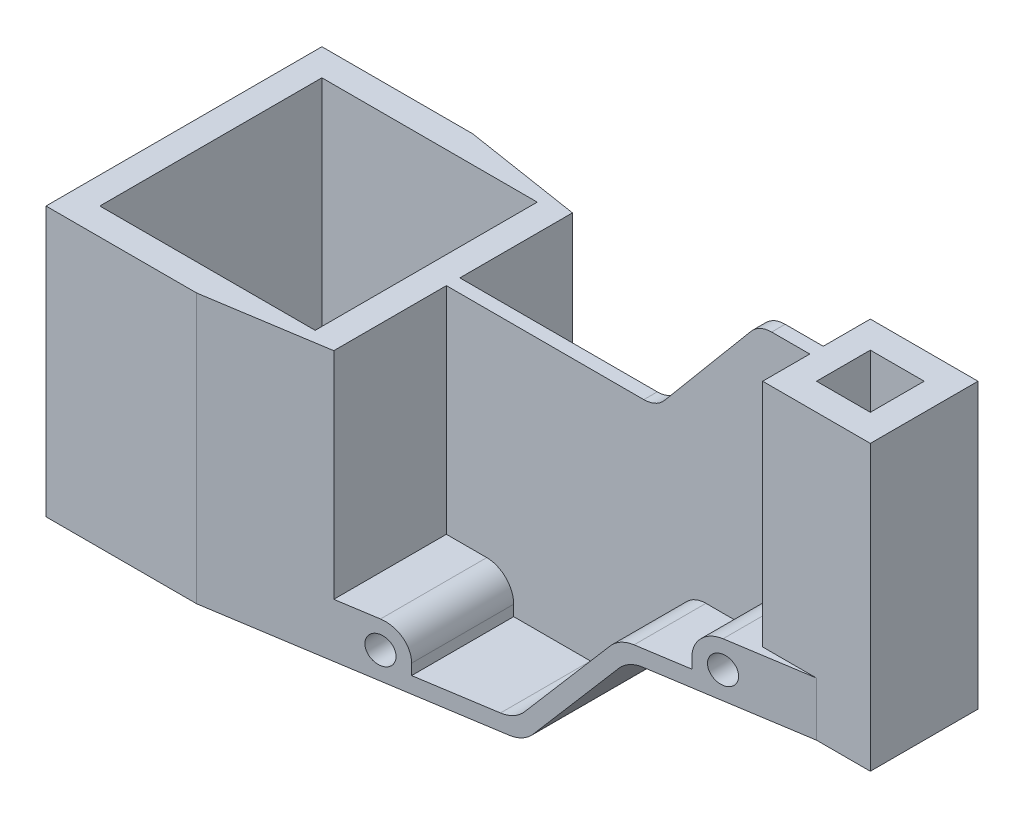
ISO-10303-21;
HEADER;
FILE_DESCRIPTION(('STEP AP214'),'2;1');
FILE_NAME('part.step','',(''),(''),'','','');
FILE_SCHEMA(('AUTOMOTIVE_DESIGN { 1 0 10303 214 1 1 1 1 }'));
ENDSEC;
DATA;
#1=APPLICATION_CONTEXT('core data for automotive mechanical design processes');
#2=APPLICATION_PROTOCOL_DEFINITION('international standard','automotive_design',2000,#1);
#3=PRODUCT_CONTEXT('',#1,'mechanical');
#4=PRODUCT('Part','Part','',(#3));
#5=PRODUCT_RELATED_PRODUCT_CATEGORY('part','',(#4));
#6=PRODUCT_DEFINITION_FORMATION('','',#4);
#7=PRODUCT_DEFINITION_CONTEXT('part definition',#1,'design');
#8=PRODUCT_DEFINITION('design','',#6,#7);
#9=PRODUCT_DEFINITION_SHAPE('','',#8);
#10=(LENGTH_UNIT() NAMED_UNIT(*) SI_UNIT(.MILLI.,.METRE.));
#11=(NAMED_UNIT(*) PLANE_ANGLE_UNIT() SI_UNIT($,.RADIAN.));
#12=(NAMED_UNIT(*) SI_UNIT($,.STERADIAN.) SOLID_ANGLE_UNIT());
#13=UNCERTAINTY_MEASURE_WITH_UNIT(LENGTH_MEASURE(1.E-05),#10,'distance_accuracy_value','');
#14=(GEOMETRIC_REPRESENTATION_CONTEXT(3) GLOBAL_UNCERTAINTY_ASSIGNED_CONTEXT((#13)) GLOBAL_UNIT_ASSIGNED_CONTEXT((#10,
#11,#12)) REPRESENTATION_CONTEXT('',''));
#15=CARTESIAN_POINT('',(0.,0.,0.));
#16=DIRECTION('',(0.,0.,1.));
#17=DIRECTION('',(1.,0.,0.));
#18=AXIS2_PLACEMENT_3D('',#15,#16,#17);
#19=CARTESIAN_POINT('',(0.,60.,51.25));
#20=DIRECTION('',(0.,-1.,0.));
#21=DIRECTION('',(0.,0.,-1.));
#22=AXIS2_PLACEMENT_3D('',#19,#20,#21);
#23=PLANE('',#22);
#24=DIRECTION('',(1.,0.,0.));
#25=VECTOR('',#24,1.);
#26=CARTESIAN_POINT('',(78.663955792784,60.,-2.5));
#27=LINE('',#26,#25);
#28=CARTESIAN_POINT('',(68.663955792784,60.,-2.5));
#29=VERTEX_POINT('',#28);
#30=CARTESIAN_POINT('',(78.663955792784,60.,-2.5));
#31=VERTEX_POINT('',#30);
#32=EDGE_CURVE('E516',#29,#31,#27,.T.);
#33=ORIENTED_EDGE('',*,*,#32,.T.);
#34=DIRECTION('',(0.,0.,1.));
#35=VECTOR('',#34,1.);
#36=CARTESIAN_POINT('',(78.663955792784,60.,20.));
#37=LINE('',#36,#35);
#38=CARTESIAN_POINT('',(78.663955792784,60.,-20.));
#39=VERTEX_POINT('',#38);
#40=EDGE_CURVE('E564',#39,#31,#37,.T.);
#41=ORIENTED_EDGE('',*,*,#40,.F.);
#42=DIRECTION('',(-1.,0.,0.));
#43=VECTOR('',#42,1.);
#44=CARTESIAN_POINT('',(78.663955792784,60.,-20.));
#45=LINE('',#44,#43);
#46=CARTESIAN_POINT('',(98.663955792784,60.,-20.));
#47=VERTEX_POINT('',#46);
#48=EDGE_CURVE('E547',#47,#39,#45,.T.);
#49=ORIENTED_EDGE('',*,*,#48,.F.);
#50=DIRECTION('',(0.987893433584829,0.,0.155134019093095));
#51=VECTOR('',#50,1.);
#52=CARTESIAN_POINT('',(13.2939837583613,60.,-33.4060885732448));
#53=LINE('',#52,#51);
#54=CARTESIAN_POINT('',(68.663955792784,60.,-24.7110552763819));
#55=VERTEX_POINT('',#54);
#56=EDGE_CURVE('E646',#55,#47,#53,.T.);
#57=ORIENTED_EDGE('',*,*,#56,.F.);
#58=DIRECTION('',(0.,0.,-1.));
#59=VECTOR('',#58,1.);
#60=CARTESIAN_POINT('',(68.663955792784,60.,51.25));
#61=LINE('',#60,#59);
#62=EDGE_CURVE('E49',#29,#55,#61,.T.);
#63=ORIENTED_EDGE('',*,*,#62,.F.);
#64=EDGE_LOOP('',(#33,#41,#49,#57,#63));
#65=FACE_BOUND('',#64,.T.);
#66=ADVANCED_FACE('F41',(#65),#23,.F.);
#67=CARTESIAN_POINT('',(68.663955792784,50.,51.25));
#68=DIRECTION('',(0.,0.,-1.));
#69=DIRECTION('',(-1.,0.,0.));
#70=AXIS2_PLACEMENT_3D('',#67,#68,#69);
#71=CYLINDRICAL_SURFACE('',#70,10.);
#72=CARTESIAN_POINT('',(68.663955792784,50.,-2.5));
#73=DIRECTION('',(0.,0.,-1.));
#74=DIRECTION('',(1.,0.,0.));
#75=AXIS2_PLACEMENT_3D('',#72,#73,#74);
#76=CIRCLE('',#75,10.);
#77=CARTESIAN_POINT('',(58.663955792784,50.,-2.5));
#78=VERTEX_POINT('',#77);
#79=EDGE_CURVE('E513',#78,#29,#76,.T.);
#80=ORIENTED_EDGE('',*,*,#79,.T.);
#81=ORIENTED_EDGE('',*,*,#62,.T.);
#82=CARTESIAN_POINT('',(68.663955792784,50.,-24.7110552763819));
#83=DIRECTION('',(0.155134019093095,0.,-0.987893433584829));
#84=DIRECTION('',(-0.987893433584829,0.,-0.155134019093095));
#85=AXIS2_PLACEMENT_3D('',#82,#83,#84);
#86=ELLIPSE('',#85,10.1225493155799,10.);
#87=CARTESIAN_POINT('',(58.663955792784,50.,-26.2814070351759));
#88=VERTEX_POINT('',#87);
#89=EDGE_CURVE('E643',#88,#55,#86,.T.);
#90=ORIENTED_EDGE('',*,*,#89,.F.);
#91=DIRECTION('',(0.,0.,-1.));
#92=VECTOR('',#91,1.);
#93=CARTESIAN_POINT('',(58.663955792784,50.,51.25));
#94=LINE('',#93,#92);
#95=EDGE_CURVE('E770',#78,#88,#94,.T.);
#96=ORIENTED_EDGE('',*,*,#95,.F.);
#97=EDGE_LOOP('',(#80,#81,#90,#96));
#98=FACE_BOUND('',#97,.T.);
#99=ADVANCED_FACE('F788',(#98),#71,.T.);
#100=CARTESIAN_POINT('',(58.663955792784,0.,51.25));
#101=DIRECTION('',(-1.,0.,0.));
#102=DIRECTION('',(0.,0.,1.));
#103=AXIS2_PLACEMENT_3D('',#100,#101,#102);
#104=PLANE('',#103);
#105=DIRECTION('',(0.,0.,-1.));
#106=VECTOR('',#105,1.);
#107=CARTESIAN_POINT('',(58.663955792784,46.,51.25));
#108=LINE('',#107,#106);
#109=CARTESIAN_POINT('',(58.663955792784,46.,-2.5));
#110=VERTEX_POINT('',#109);
#111=CARTESIAN_POINT('',(58.663955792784,46.,-26.2814070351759));
#112=VERTEX_POINT('',#111);
#113=EDGE_CURVE('E767',#110,#112,#108,.T.);
#114=ORIENTED_EDGE('',*,*,#113,.F.);
#115=DIRECTION('',(0.,1.,0.));
#116=VECTOR('',#115,1.);
#117=CARTESIAN_POINT('',(58.663955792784,46.,-2.5));
#118=LINE('',#117,#116);
#119=EDGE_CURVE('E510',#110,#78,#118,.T.);
#120=ORIENTED_EDGE('',*,*,#119,.T.);
#121=ORIENTED_EDGE('',*,*,#95,.T.);
#122=DIRECTION('',(0.,-1.,0.));
#123=VECTOR('',#122,1.);
#124=CARTESIAN_POINT('',(58.663955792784,0.,-26.2814070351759));
#125=LINE('',#124,#123);
#126=EDGE_CURVE('E640',#88,#112,#125,.T.);
#127=ORIENTED_EDGE('',*,*,#126,.T.);
#128=EDGE_LOOP('',(#114,#120,#121,#127));
#129=FACE_BOUND('',#128,.T.);
#130=ADVANCED_FACE('F780',(#129),#104,.T.);
#131=CARTESIAN_POINT('',(0.,46.,51.25));
#132=DIRECTION('',(0.,1.,0.));
#133=DIRECTION('',(-1.,0.,0.));
#134=AXIS2_PLACEMENT_3D('',#131,#132,#133);
#135=PLANE('',#134);
#136=DIRECTION('',(0.,0.,-1.));
#137=VECTOR('',#136,1.);
#138=CARTESIAN_POINT('',(40.092292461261,46.,51.25));
#139=LINE('',#138,#137);
#140=CARTESIAN_POINT('',(40.092292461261,46.,-2.5));
#141=VERTEX_POINT('',#140);
#142=CARTESIAN_POINT('',(40.092292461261,46.,-29.1978114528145));
#143=VERTEX_POINT('',#142);
#144=EDGE_CURVE('E763',#141,#143,#139,.T.);
#145=ORIENTED_EDGE('',*,*,#144,.F.);
#146=DIRECTION('',(1.,0.,0.));
#147=VECTOR('',#146,1.);
#148=CARTESIAN_POINT('',(40.092292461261,46.,-2.5));
#149=LINE('',#148,#147);
#150=EDGE_CURVE('E507',#141,#110,#149,.T.);
#151=ORIENTED_EDGE('',*,*,#150,.T.);
#152=ORIENTED_EDGE('',*,*,#113,.T.);
#153=DIRECTION('',(-0.987893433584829,0.,-0.155134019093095));
#154=VECTOR('',#153,1.);
#155=CARTESIAN_POINT('',(13.2939837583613,46.,-33.4060885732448));
#156=LINE('',#155,#154);
#157=EDGE_CURVE('E637',#112,#143,#156,.T.);
#158=ORIENTED_EDGE('',*,*,#157,.T.);
#159=EDGE_LOOP('',(#145,#151,#152,#158));
#160=FACE_BOUND('',#159,.T.);
#161=ADVANCED_FACE('F857',(#160),#135,.T.);
#162=CARTESIAN_POINT('',(40.092292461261,36.,51.25));
#163=DIRECTION('',(0.,0.,-1.));
#164=DIRECTION('',(-1.,0.,0.));
#165=AXIS2_PLACEMENT_3D('',#162,#163,#164);
#166=CYLINDRICAL_SURFACE('',#165,9.99999999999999);
#167=DIRECTION('',(0.,0.,-1.));
#168=VECTOR('',#167,1.);
#169=CARTESIAN_POINT('',(32.4318480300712,42.4278760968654,51.25));
#170=LINE('',#169,#168);
#171=CARTESIAN_POINT('',(32.4318480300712,42.4278760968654,-2.5));
#172=VERTEX_POINT('',#171);
#173=CARTESIAN_POINT('',(32.4318480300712,42.4278760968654,-30.4007706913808));
#174=VERTEX_POINT('',#173);
#175=EDGE_CURVE('E759',#172,#174,#170,.T.);
#176=ORIENTED_EDGE('',*,*,#175,.F.);
#177=CARTESIAN_POINT('',(40.092292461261,36.,-2.5));
#178=DIRECTION('',(0.,0.,-1.));
#179=DIRECTION('',(1.,0.,0.));
#180=AXIS2_PLACEMENT_3D('',#177,#178,#179);
#181=CIRCLE('',#180,9.99999999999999);
#182=EDGE_CURVE('E504',#172,#141,#181,.T.);
#183=ORIENTED_EDGE('',*,*,#182,.T.);
#184=ORIENTED_EDGE('',*,*,#144,.T.);
#185=CARTESIAN_POINT('',(40.092292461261,36.,-29.1978114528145));
#186=DIRECTION('',(0.155134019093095,0.,-0.987893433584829));
#187=DIRECTION('',(-0.987893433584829,0.,-0.155134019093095));
#188=AXIS2_PLACEMENT_3D('',#185,#186,#187);
#189=ELLIPSE('',#188,10.1225493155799,9.99999999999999);
#190=EDGE_CURVE('E634',#143,#174,#189,.F.);
#191=ORIENTED_EDGE('',*,*,#190,.T.);
#192=EDGE_LOOP('',(#176,#183,#184,#191));
#193=FACE_BOUND('',#192,.T.);
#194=ADVANCED_FACE('F854',(#193),#166,.T.);
#195=CARTESIAN_POINT('',(-1.85986099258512,1.56060867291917,51.25));
#196=DIRECTION('',(-0.76604444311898,0.642787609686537,0.));
#197=DIRECTION('',(-0.642787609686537,-0.76604444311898,0.));
#198=AXIS2_PLACEMENT_3D('',#195,#196,#197);
#199=PLANE('',#198);
#200=DIRECTION('',(0.,0.,-1.));
#201=VECTOR('',#200,1.);
#202=CARTESIAN_POINT('',(4.8625984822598,9.57212390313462,51.25));
#203=LINE('',#202,#201);
#204=CARTESIAN_POINT('',(4.86259848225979,9.57212390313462,-2.5));
#205=VERTEX_POINT('',#204);
#206=CARTESIAN_POINT('',(4.8625984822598,9.57212390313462,-34.7301126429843));
#207=VERTEX_POINT('',#206);
#208=EDGE_CURVE('E755',#205,#207,#203,.T.);
#209=ORIENTED_EDGE('',*,*,#208,.F.);
#210=DIRECTION('',(0.642787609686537,0.76604444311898,0.));
#211=VECTOR('',#210,1.);
#212=CARTESIAN_POINT('',(4.86259848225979,9.57212390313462,-2.5));
#213=LINE('',#212,#211);
#214=EDGE_CURVE('E501',#205,#172,#213,.T.);
#215=ORIENTED_EDGE('',*,*,#214,.T.);
#216=ORIENTED_EDGE('',*,*,#175,.T.);
#217=DIRECTION('',(-0.639537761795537,-0.762171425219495,-0.100429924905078));
#218=VECTOR('',#217,1.);
#219=CARTESIAN_POINT('',(3.73033626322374,8.22274633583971,-34.9079176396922));
#220=LINE('',#219,#218);
#221=EDGE_CURVE('E631',#174,#207,#220,.T.);
#222=ORIENTED_EDGE('',*,*,#221,.T.);
#223=EDGE_LOOP('',(#209,#215,#216,#222));
#224=FACE_BOUND('',#223,.T.);
#225=ADVANCED_FACE('F851',(#224),#199,.T.);
#226=CARTESIAN_POINT('',(-2.79784594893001,16.,51.25));
#227=DIRECTION('',(0.,0.,-1.));
#228=DIRECTION('',(-1.,0.,0.));
#229=AXIS2_PLACEMENT_3D('',#226,#227,#228);
#230=CYLINDRICAL_SURFACE('',#229,10.);
#231=DIRECTION('',(0.,0.,-1.));
#232=VECTOR('',#231,1.);
#233=CARTESIAN_POINT('',(-2.79784594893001,6.,51.25));
#234=LINE('',#233,#232);
#235=CARTESIAN_POINT('',(-2.79784594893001,6.,-2.5));
#236=VERTEX_POINT('',#235);
#237=CARTESIAN_POINT('',(-2.79784594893,6.,-35.9330718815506));
#238=VERTEX_POINT('',#237);
#239=EDGE_CURVE('E751',#236,#238,#234,.T.);
#240=ORIENTED_EDGE('',*,*,#239,.F.);
#241=CARTESIAN_POINT('',(-2.79784594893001,16.,-2.5));
#242=DIRECTION('',(0.,0.,1.));
#243=DIRECTION('',(1.,0.,0.));
#244=AXIS2_PLACEMENT_3D('',#241,#242,#243);
#245=CIRCLE('',#244,10.);
#246=EDGE_CURVE('E498',#236,#205,#245,.T.);
#247=ORIENTED_EDGE('',*,*,#246,.T.);
#248=ORIENTED_EDGE('',*,*,#208,.T.);
#249=CARTESIAN_POINT('',(-2.79784594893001,16.,-35.9330718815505));
#250=DIRECTION('',(0.155134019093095,0.,-0.987893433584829));
#251=DIRECTION('',(-0.987893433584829,0.,-0.155134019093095));
#252=AXIS2_PLACEMENT_3D('',#249,#250,#251);
#253=ELLIPSE('',#252,10.1225493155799,10.);
#254=EDGE_CURVE('E628',#207,#238,#253,.T.);
#255=ORIENTED_EDGE('',*,*,#254,.T.);
#256=EDGE_LOOP('',(#240,#247,#248,#255));
#257=FACE_BOUND('',#256,.T.);
#258=ADVANCED_FACE('F848',(#257),#230,.F.);
#259=CARTESIAN_POINT('',(0.,6.,51.25));
#260=DIRECTION('',(0.,1.,0.));
#261=DIRECTION('',(-1.,0.,0.));
#262=AXIS2_PLACEMENT_3D('',#259,#260,#261);
#263=PLANE('',#262);
#264=DIRECTION('',(0.,0.,-1.));
#265=VECTOR('',#264,1.);
#266=CARTESIAN_POINT('',(-31.3360442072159,6.,51.25));
#267=LINE('',#266,#265);
#268=CARTESIAN_POINT('',(-31.3360442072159,6.,-2.5));
#269=VERTEX_POINT('',#268);
#270=CARTESIAN_POINT('',(-31.3360442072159,6.,-40.4145728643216));
#271=VERTEX_POINT('',#270);
#272=EDGE_CURVE('E747',#269,#271,#267,.T.);
#273=ORIENTED_EDGE('',*,*,#272,.F.);
#274=DIRECTION('',(1.,0.,0.));
#275=VECTOR('',#274,1.);
#276=CARTESIAN_POINT('',(-31.3360442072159,6.,-2.5));
#277=LINE('',#276,#275);
#278=EDGE_CURVE('E495',#269,#236,#277,.T.);
#279=ORIENTED_EDGE('',*,*,#278,.T.);
#280=ORIENTED_EDGE('',*,*,#239,.T.);
#281=DIRECTION('',(-0.987893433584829,0.,-0.155134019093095));
#282=VECTOR('',#281,1.);
#283=CARTESIAN_POINT('',(13.2939837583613,6.,-33.4060885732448));
#284=LINE('',#283,#282);
#285=EDGE_CURVE('E625',#238,#271,#284,.T.);
#286=ORIENTED_EDGE('',*,*,#285,.T.);
#287=EDGE_LOOP('',(#273,#279,#280,#286));
#288=FACE_BOUND('',#287,.T.);
#289=ADVANCED_FACE('F843',(#288),#263,.T.);
#290=CARTESIAN_POINT('',(-31.3360442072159,0.,51.25));
#291=DIRECTION('',(1.,0.,0.));
#292=DIRECTION('',(0.,0.,-1.));
#293=AXIS2_PLACEMENT_3D('',#290,#291,#292);
#294=PLANE('',#293);
#295=DIRECTION('',(0.,0.,-1.));
#296=VECTOR('',#295,1.);
#297=CARTESIAN_POINT('',(-31.3360442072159,10.,51.25));
#298=LINE('',#297,#296);
#299=CARTESIAN_POINT('',(-31.3360442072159,10.,-2.5));
#300=VERTEX_POINT('',#299);
#301=CARTESIAN_POINT('',(-31.3360442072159,10.,-40.4145728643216));
#302=VERTEX_POINT('',#301);
#303=EDGE_CURVE('E743',#300,#302,#298,.T.);
#304=ORIENTED_EDGE('',*,*,#303,.F.);
#305=DIRECTION('',(0.,-1.,0.));
#306=VECTOR('',#305,1.);
#307=CARTESIAN_POINT('',(-31.3360442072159,10.,-2.5));
#308=LINE('',#307,#306);
#309=EDGE_CURVE('E492',#300,#269,#308,.T.);
#310=ORIENTED_EDGE('',*,*,#309,.T.);
#311=ORIENTED_EDGE('',*,*,#272,.T.);
#312=DIRECTION('',(0.,1.,0.));
#313=VECTOR('',#312,1.);
#314=CARTESIAN_POINT('',(-31.3360442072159,0.,-40.4145728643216));
#315=LINE('',#314,#313);
#316=EDGE_CURVE('E622',#271,#302,#315,.T.);
#317=ORIENTED_EDGE('',*,*,#316,.T.);
#318=EDGE_LOOP('',(#304,#310,#311,#317));
#319=FACE_BOUND('',#318,.T.);
#320=ADVANCED_FACE('F840',(#319),#294,.T.);
#321=CARTESIAN_POINT('',(-41.3360442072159,9.99999999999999,51.25));
#322=DIRECTION('',(0.,0.,-1.));
#323=DIRECTION('',(-1.,0.,0.));
#324=AXIS2_PLACEMENT_3D('',#321,#322,#323);
#325=CYLINDRICAL_SURFACE('',#324,10.);
#326=DIRECTION('',(0.,0.,-1.));
#327=VECTOR('',#326,1.);
#328=CARTESIAN_POINT('',(-41.3360442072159,20.,51.25));
#329=LINE('',#328,#327);
#330=CARTESIAN_POINT('',(-41.3360442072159,20.,-2.5));
#331=VERTEX_POINT('',#330);
#332=CARTESIAN_POINT('',(-41.3360442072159,20.,-41.9849246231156));
#333=VERTEX_POINT('',#332);
#334=EDGE_CURVE('E739',#331,#333,#329,.T.);
#335=ORIENTED_EDGE('',*,*,#334,.F.);
#336=CARTESIAN_POINT('',(-41.3360442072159,9.99999999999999,-2.5));
#337=DIRECTION('',(0.,0.,-1.));
#338=DIRECTION('',(1.,0.,0.));
#339=AXIS2_PLACEMENT_3D('',#336,#337,#338);
#340=CIRCLE('',#339,10.);
#341=EDGE_CURVE('E489',#331,#300,#340,.T.);
#342=ORIENTED_EDGE('',*,*,#341,.T.);
#343=ORIENTED_EDGE('',*,*,#303,.T.);
#344=CARTESIAN_POINT('',(-41.3360442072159,9.99999999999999,-41.9849246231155));
#345=DIRECTION('',(0.155134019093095,0.,-0.987893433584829));
#346=DIRECTION('',(-0.987893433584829,0.,-0.155134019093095));
#347=AXIS2_PLACEMENT_3D('',#344,#345,#346);
#348=ELLIPSE('',#347,10.1225493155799,10.);
#349=EDGE_CURVE('E619',#302,#333,#348,.F.);
#350=ORIENTED_EDGE('',*,*,#349,.T.);
#351=EDGE_LOOP('',(#335,#342,#343,#350));
#352=FACE_BOUND('',#351,.T.);
#353=ADVANCED_FACE('F835',(#352),#325,.T.);
#354=CARTESIAN_POINT('',(0.,20.,51.25));
#355=DIRECTION('',(0.,1.,0.));
#356=DIRECTION('',(0.,0.,1.));
#357=AXIS2_PLACEMENT_3D('',#354,#355,#356);
#358=PLANE('',#357);
#359=DIRECTION('',(0.,0.,-1.));
#360=VECTOR('',#359,1.);
#361=CARTESIAN_POINT('',(-56.336044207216,20.,51.25));
#362=LINE('',#361,#360);
#363=CARTESIAN_POINT('',(-56.336044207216,20.,-2.5));
#364=VERTEX_POINT('',#363);
#365=CARTESIAN_POINT('',(-56.336044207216,20.,-44.3404522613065));
#366=VERTEX_POINT('',#365);
#367=EDGE_CURVE('E735',#364,#366,#362,.T.);
#368=ORIENTED_EDGE('',*,*,#367,.F.);
#369=DIRECTION('',(1.,0.,0.));
#370=VECTOR('',#369,1.);
#371=CARTESIAN_POINT('',(-56.336044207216,20.,-2.5));
#372=LINE('',#371,#370);
#373=EDGE_CURVE('E486',#364,#331,#372,.T.);
#374=ORIENTED_EDGE('',*,*,#373,.T.);
#375=ORIENTED_EDGE('',*,*,#334,.T.);
#376=DIRECTION('',(-0.987893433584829,0.,-0.155134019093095));
#377=VECTOR('',#376,1.);
#378=CARTESIAN_POINT('',(13.2939837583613,20.,-33.4060885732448));
#379=LINE('',#378,#377);
#380=EDGE_CURVE('E616',#333,#366,#379,.T.);
#381=ORIENTED_EDGE('',*,*,#380,.T.);
#382=EDGE_LOOP('',(#368,#374,#375,#381));
#383=FACE_BOUND('',#382,.T.);
#384=ADVANCED_FACE('F832',(#383),#358,.T.);
#385=CARTESIAN_POINT('',(-56.336044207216,0.,51.25));
#386=DIRECTION('',(1.,0.,0.));
#387=DIRECTION('',(0.,1.,0.));
#388=AXIS2_PLACEMENT_3D('',#385,#386,#387);
#389=PLANE('',#388);
#390=DIRECTION('',(0.,0.,-1.));
#391=VECTOR('',#390,1.);
#392=CARTESIAN_POINT('',(-56.336044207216,100.,51.25));
#393=LINE('',#392,#391);
#394=CARTESIAN_POINT('',(-56.336044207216,100.,-2.5));
#395=VERTEX_POINT('',#394);
#396=CARTESIAN_POINT('',(-56.336044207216,100.,-44.3404522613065));
#397=VERTEX_POINT('',#396);
#398=EDGE_CURVE('E731',#395,#397,#393,.T.);
#399=ORIENTED_EDGE('',*,*,#398,.F.);
#400=DIRECTION('',(0.,-1.,0.));
#401=VECTOR('',#400,1.);
#402=CARTESIAN_POINT('',(-56.336044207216,100.,-2.5));
#403=LINE('',#402,#401);
#404=EDGE_CURVE('E483',#395,#364,#403,.T.);
#405=ORIENTED_EDGE('',*,*,#404,.T.);
#406=ORIENTED_EDGE('',*,*,#367,.T.);
#407=DIRECTION('',(0.,1.,0.));
#408=VECTOR('',#407,1.);
#409=CARTESIAN_POINT('',(-56.336044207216,0.,-44.3404522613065));
#410=LINE('',#409,#408);
#411=EDGE_CURVE('E613',#366,#397,#410,.T.);
#412=ORIENTED_EDGE('',*,*,#411,.T.);
#413=EDGE_LOOP('',(#399,#405,#406,#412));
#414=FACE_BOUND('',#413,.T.);
#415=ADVANCED_FACE('F827',(#414),#389,.T.);
#416=CARTESIAN_POINT('',(78.663955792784,145.5,20.));
#417=DIRECTION('',(1.,0.,0.));
#418=DIRECTION('',(0.,0.,-1.));
#419=AXIS2_PLACEMENT_3D('',#416,#417,#418);
#420=PLANE('',#419);
#421=DIRECTION('',(0.,1.,0.));
#422=VECTOR('',#421,1.);
#423=CARTESIAN_POINT('',(78.663955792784,145.5,-2.5));
#424=LINE('',#423,#422);
#425=CARTESIAN_POINT('',(78.663955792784,145.5,-2.5));
#426=VERTEX_POINT('',#425);
#427=EDGE_CURVE('E519',#31,#426,#424,.T.);
#428=ORIENTED_EDGE('',*,*,#427,.T.);
#429=DIRECTION('',(0.,0.,1.));
#430=VECTOR('',#429,1.);
#431=CARTESIAN_POINT('',(78.663955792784,145.5,20.));
#432=LINE('',#431,#430);
#433=CARTESIAN_POINT('',(78.663955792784,145.5,-20.));
#434=VERTEX_POINT('',#433);
#435=EDGE_CURVE('E555',#434,#426,#432,.T.);
#436=ORIENTED_EDGE('',*,*,#435,.F.);
#437=DIRECTION('',(0.,-1.,0.));
#438=VECTOR('',#437,1.);
#439=CARTESIAN_POINT('',(78.663955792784,145.5,-20.));
#440=LINE('',#439,#438);
#441=EDGE_CURVE('E573',#434,#39,#440,.T.);
#442=ORIENTED_EDGE('',*,*,#441,.T.);
#443=ORIENTED_EDGE('',*,*,#40,.T.);
#444=EDGE_LOOP('',(#428,#436,#442,#443));
#445=FACE_BOUND('',#444,.T.);
#446=ADVANCED_FACE('F864',(#445),#420,.F.);
#447=CARTESIAN_POINT('',(78.663955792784,60.,2.5));
#448=VERTEX_POINT('',#447);
#449=CARTESIAN_POINT('',(78.663955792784,60.,20.));
#450=VERTEX_POINT('',#449);
#451=EDGE_CURVE('E563',#448,#450,#37,.T.);
#452=ORIENTED_EDGE('',*,*,#451,.F.);
#453=DIRECTION('',(1.,0.,0.));
#454=VECTOR('',#453,1.);
#455=CARTESIAN_POINT('',(78.663955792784,60.,2.5));
#456=LINE('',#455,#454);
#457=CARTESIAN_POINT('',(68.663955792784,60.,2.5));
#458=VERTEX_POINT('',#457);
#459=EDGE_CURVE('E467',#458,#448,#456,.T.);
#460=ORIENTED_EDGE('',*,*,#459,.F.);
#461=CARTESIAN_POINT('',(68.663955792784,60.,24.7110552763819));
#462=VERTEX_POINT('',#461);
#463=EDGE_CURVE('E11',#462,#458,#61,.T.);
#464=ORIENTED_EDGE('',*,*,#463,.F.);
#465=DIRECTION('',(-0.987893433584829,0.,0.155134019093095));
#466=VECTOR('',#465,1.);
#467=CARTESIAN_POINT('',(-2.41474381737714,60.,35.8729113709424));
#468=LINE('',#467,#466);
#469=CARTESIAN_POINT('',(98.663955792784,60.,20.));
#470=VERTEX_POINT('',#469);
#471=EDGE_CURVE('E696',#470,#462,#468,.T.);
#472=ORIENTED_EDGE('',*,*,#471,.F.);
#473=DIRECTION('',(1.,0.,0.));
#474=VECTOR('',#473,1.);
#475=CARTESIAN_POINT('',(78.663955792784,60.,20.));
#476=LINE('',#475,#474);
#477=EDGE_CURVE('E552',#450,#470,#476,.T.);
#478=ORIENTED_EDGE('',*,*,#477,.F.);
#479=EDGE_LOOP('',(#452,#460,#464,#472,#478));
#480=FACE_BOUND('',#479,.T.);
#481=ADVANCED_FACE('F888',(#480),#23,.F.);
#482=ORIENTED_EDGE('',*,*,#463,.T.);
#483=CARTESIAN_POINT('',(68.663955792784,50.,2.5));
#484=DIRECTION('',(0.,0.,-1.));
#485=DIRECTION('',(1.,0.,0.));
#486=AXIS2_PLACEMENT_3D('',#483,#484,#485);
#487=CIRCLE('',#486,10.);
#488=CARTESIAN_POINT('',(58.663955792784,50.,2.5));
#489=VERTEX_POINT('',#488);
#490=EDGE_CURVE('E465',#489,#458,#487,.T.);
#491=ORIENTED_EDGE('',*,*,#490,.F.);
#492=CARTESIAN_POINT('',(58.663955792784,50.,26.2814070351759));
#493=VERTEX_POINT('',#492);
#494=EDGE_CURVE('E771',#493,#489,#94,.T.);
#495=ORIENTED_EDGE('',*,*,#494,.F.);
#496=CARTESIAN_POINT('',(68.663955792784,50.,24.7110552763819));
#497=DIRECTION('',(0.155134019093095,0.,0.987893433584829));
#498=DIRECTION('',(0.987893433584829,0.,-0.155134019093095));
#499=AXIS2_PLACEMENT_3D('',#496,#497,#498);
#500=ELLIPSE('',#499,10.1225493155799,10.);
#501=EDGE_CURVE('E694',#462,#493,#500,.T.);
#502=ORIENTED_EDGE('',*,*,#501,.F.);
#503=EDGE_LOOP('',(#482,#491,#495,#502));
#504=FACE_BOUND('',#503,.T.);
#505=ADVANCED_FACE('F893',(#504),#71,.T.);
#506=DIRECTION('',(0.,1.,0.));
#507=VECTOR('',#506,1.);
#508=CARTESIAN_POINT('',(58.663955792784,46.,2.5));
#509=LINE('',#508,#507);
#510=CARTESIAN_POINT('',(58.663955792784,46.,2.5));
#511=VERTEX_POINT('',#510);
#512=EDGE_CURVE('E463',#511,#489,#509,.T.);
#513=ORIENTED_EDGE('',*,*,#512,.F.);
#514=CARTESIAN_POINT('',(58.663955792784,46.,26.2814070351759));
#515=VERTEX_POINT('',#514);
#516=EDGE_CURVE('E768',#515,#511,#108,.T.);
#517=ORIENTED_EDGE('',*,*,#516,.F.);
#518=DIRECTION('',(0.,1.,0.));
#519=VECTOR('',#518,1.);
#520=CARTESIAN_POINT('',(58.663955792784,0.,26.2814070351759));
#521=LINE('',#520,#519);
#522=EDGE_CURVE('E691',#515,#493,#521,.T.);
#523=ORIENTED_EDGE('',*,*,#522,.T.);
#524=ORIENTED_EDGE('',*,*,#494,.T.);
#525=EDGE_LOOP('',(#513,#517,#523,#524));
#526=FACE_BOUND('',#525,.T.);
#527=ADVANCED_FACE('F900',(#526),#104,.T.);
#528=DIRECTION('',(1.,0.,0.));
#529=VECTOR('',#528,1.);
#530=CARTESIAN_POINT('',(40.092292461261,46.,2.5));
#531=LINE('',#530,#529);
#532=CARTESIAN_POINT('',(40.092292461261,46.,2.5));
#533=VERTEX_POINT('',#532);
#534=EDGE_CURVE('E461',#533,#511,#531,.T.);
#535=ORIENTED_EDGE('',*,*,#534,.F.);
#536=CARTESIAN_POINT('',(40.092292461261,46.,29.1978114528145));
#537=VERTEX_POINT('',#536);
#538=EDGE_CURVE('E764',#537,#533,#139,.T.);
#539=ORIENTED_EDGE('',*,*,#538,.F.);
#540=DIRECTION('',(0.987893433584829,0.,-0.155134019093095));
#541=VECTOR('',#540,1.);
#542=CARTESIAN_POINT('',(-2.41474381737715,46.,35.8729113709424));
#543=LINE('',#542,#541);
#544=EDGE_CURVE('E688',#537,#515,#543,.T.);
#545=ORIENTED_EDGE('',*,*,#544,.T.);
#546=ORIENTED_EDGE('',*,*,#516,.T.);
#547=EDGE_LOOP('',(#535,#539,#545,#546));
#548=FACE_BOUND('',#547,.T.);
#549=ADVANCED_FACE('F968',(#548),#135,.T.);
#550=CARTESIAN_POINT('',(40.092292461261,36.,2.5));
#551=DIRECTION('',(0.,0.,-1.));
#552=DIRECTION('',(1.,0.,0.));
#553=AXIS2_PLACEMENT_3D('',#550,#551,#552);
#554=CIRCLE('',#553,9.99999999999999);
#555=CARTESIAN_POINT('',(32.4318480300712,42.4278760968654,2.5));
#556=VERTEX_POINT('',#555);
#557=EDGE_CURVE('E459',#556,#533,#554,.T.);
#558=ORIENTED_EDGE('',*,*,#557,.F.);
#559=CARTESIAN_POINT('',(32.4318480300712,42.4278760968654,30.4007706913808));
#560=VERTEX_POINT('',#559);
#561=EDGE_CURVE('E760',#560,#556,#170,.T.);
#562=ORIENTED_EDGE('',*,*,#561,.F.);
#563=CARTESIAN_POINT('',(40.092292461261,36.,29.1978114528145));
#564=DIRECTION('',(0.155134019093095,0.,0.987893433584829));
#565=DIRECTION('',(0.987893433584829,0.,-0.155134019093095));
#566=AXIS2_PLACEMENT_3D('',#563,#564,#565);
#567=ELLIPSE('',#566,10.1225493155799,9.99999999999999);
#568=EDGE_CURVE('E685',#560,#537,#567,.F.);
#569=ORIENTED_EDGE('',*,*,#568,.T.);
#570=ORIENTED_EDGE('',*,*,#538,.T.);
#571=EDGE_LOOP('',(#558,#562,#569,#570));
#572=FACE_BOUND('',#571,.T.);
#573=ADVANCED_FACE('F964',(#572),#166,.T.);
#574=DIRECTION('',(0.642787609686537,0.76604444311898,0.));
#575=VECTOR('',#574,1.);
#576=CARTESIAN_POINT('',(4.86259848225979,9.57212390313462,2.5));
#577=LINE('',#576,#575);
#578=CARTESIAN_POINT('',(4.86259848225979,9.57212390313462,2.5));
#579=VERTEX_POINT('',#578);
#580=EDGE_CURVE('E457',#579,#556,#577,.T.);
#581=ORIENTED_EDGE('',*,*,#580,.F.);
#582=CARTESIAN_POINT('',(4.8625984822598,9.57212390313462,34.7301126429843));
#583=VERTEX_POINT('',#582);
#584=EDGE_CURVE('E756',#583,#579,#203,.T.);
#585=ORIENTED_EDGE('',*,*,#584,.F.);
#586=DIRECTION('',(0.639537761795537,0.762171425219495,-0.100429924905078));
#587=VECTOR('',#586,1.);
#588=CARTESIAN_POINT('',(-2.8531084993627,0.376902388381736,35.9417500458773));
#589=LINE('',#588,#587);
#590=EDGE_CURVE('E682',#583,#560,#589,.T.);
#591=ORIENTED_EDGE('',*,*,#590,.T.);
#592=ORIENTED_EDGE('',*,*,#561,.T.);
#593=EDGE_LOOP('',(#581,#585,#591,#592));
#594=FACE_BOUND('',#593,.T.);
#595=ADVANCED_FACE('F961',(#594),#199,.T.);
#596=CARTESIAN_POINT('',(-2.79784594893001,16.,2.5));
#597=DIRECTION('',(0.,0.,1.));
#598=DIRECTION('',(1.,0.,0.));
#599=AXIS2_PLACEMENT_3D('',#596,#597,#598);
#600=CIRCLE('',#599,10.);
#601=CARTESIAN_POINT('',(-2.79784594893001,6.,2.5));
#602=VERTEX_POINT('',#601);
#603=EDGE_CURVE('E455',#602,#579,#600,.T.);
#604=ORIENTED_EDGE('',*,*,#603,.F.);
#605=CARTESIAN_POINT('',(-2.79784594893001,6.,35.9330718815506));
#606=VERTEX_POINT('',#605);
#607=EDGE_CURVE('E752',#606,#602,#234,.T.);
#608=ORIENTED_EDGE('',*,*,#607,.F.);
#609=CARTESIAN_POINT('',(-2.79784594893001,16.,35.9330718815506));
#610=DIRECTION('',(0.155134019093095,0.,0.987893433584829));
#611=DIRECTION('',(0.987893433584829,0.,-0.155134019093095));
#612=AXIS2_PLACEMENT_3D('',#609,#610,#611);
#613=ELLIPSE('',#612,10.1225493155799,10.);
#614=EDGE_CURVE('E679',#606,#583,#613,.T.);
#615=ORIENTED_EDGE('',*,*,#614,.T.);
#616=ORIENTED_EDGE('',*,*,#584,.T.);
#617=EDGE_LOOP('',(#604,#608,#615,#616));
#618=FACE_BOUND('',#617,.T.);
#619=ADVANCED_FACE('F956',(#618),#230,.F.);
#620=DIRECTION('',(1.,0.,0.));
#621=VECTOR('',#620,1.);
#622=CARTESIAN_POINT('',(-31.3360442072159,6.,2.5));
#623=LINE('',#622,#621);
#624=CARTESIAN_POINT('',(-31.3360442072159,6.,2.5));
#625=VERTEX_POINT('',#624);
#626=EDGE_CURVE('E453',#625,#602,#623,.T.);
#627=ORIENTED_EDGE('',*,*,#626,.F.);
#628=CARTESIAN_POINT('',(-31.3360442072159,6.,40.4145728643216));
#629=VERTEX_POINT('',#628);
#630=EDGE_CURVE('E748',#629,#625,#267,.T.);
#631=ORIENTED_EDGE('',*,*,#630,.F.);
#632=DIRECTION('',(0.987893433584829,0.,-0.155134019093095));
#633=VECTOR('',#632,1.);
#634=CARTESIAN_POINT('',(-2.41474381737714,6.,35.8729113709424));
#635=LINE('',#634,#633);
#636=EDGE_CURVE('E676',#629,#606,#635,.T.);
#637=ORIENTED_EDGE('',*,*,#636,.T.);
#638=ORIENTED_EDGE('',*,*,#607,.T.);
#639=EDGE_LOOP('',(#627,#631,#637,#638));
#640=FACE_BOUND('',#639,.T.);
#641=ADVANCED_FACE('F953',(#640),#263,.T.);
#642=DIRECTION('',(0.,-1.,0.));
#643=VECTOR('',#642,1.);
#644=CARTESIAN_POINT('',(-31.3360442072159,10.,2.5));
#645=LINE('',#644,#643);
#646=CARTESIAN_POINT('',(-31.3360442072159,10.,2.5));
#647=VERTEX_POINT('',#646);
#648=EDGE_CURVE('E451',#647,#625,#645,.T.);
#649=ORIENTED_EDGE('',*,*,#648,.F.);
#650=CARTESIAN_POINT('',(-31.3360442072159,10.,40.4145728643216));
#651=VERTEX_POINT('',#650);
#652=EDGE_CURVE('E744',#651,#647,#298,.T.);
#653=ORIENTED_EDGE('',*,*,#652,.F.);
#654=DIRECTION('',(0.,-1.,0.));
#655=VECTOR('',#654,1.);
#656=CARTESIAN_POINT('',(-31.3360442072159,0.,40.4145728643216));
#657=LINE('',#656,#655);
#658=EDGE_CURVE('E673',#651,#629,#657,.T.);
#659=ORIENTED_EDGE('',*,*,#658,.T.);
#660=ORIENTED_EDGE('',*,*,#630,.T.);
#661=EDGE_LOOP('',(#649,#653,#659,#660));
#662=FACE_BOUND('',#661,.T.);
#663=ADVANCED_FACE('F948',(#662),#294,.T.);
#664=CARTESIAN_POINT('',(-41.3360442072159,9.99999999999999,2.5));
#665=DIRECTION('',(0.,0.,-1.));
#666=DIRECTION('',(1.,0.,0.));
#667=AXIS2_PLACEMENT_3D('',#664,#665,#666);
#668=CIRCLE('',#667,10.);
#669=CARTESIAN_POINT('',(-41.3360442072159,20.,2.5));
#670=VERTEX_POINT('',#669);
#671=EDGE_CURVE('E449',#670,#647,#668,.T.);
#672=ORIENTED_EDGE('',*,*,#671,.F.);
#673=CARTESIAN_POINT('',(-41.3360442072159,20.,41.9849246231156));
#674=VERTEX_POINT('',#673);
#675=EDGE_CURVE('E740',#674,#670,#329,.T.);
#676=ORIENTED_EDGE('',*,*,#675,.F.);
#677=CARTESIAN_POINT('',(-41.3360442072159,9.99999999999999,41.9849246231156));
#678=DIRECTION('',(0.155134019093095,0.,0.987893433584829));
#679=DIRECTION('',(0.987893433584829,0.,-0.155134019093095));
#680=AXIS2_PLACEMENT_3D('',#677,#678,#679);
#681=ELLIPSE('',#680,10.1225493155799,10.);
#682=EDGE_CURVE('E670',#674,#651,#681,.F.);
#683=ORIENTED_EDGE('',*,*,#682,.T.);
#684=ORIENTED_EDGE('',*,*,#652,.T.);
#685=EDGE_LOOP('',(#672,#676,#683,#684));
#686=FACE_BOUND('',#685,.T.);
#687=ADVANCED_FACE('F945',(#686),#325,.T.);
#688=DIRECTION('',(1.,0.,0.));
#689=VECTOR('',#688,1.);
#690=CARTESIAN_POINT('',(-56.336044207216,20.,2.5));
#691=LINE('',#690,#689);
#692=CARTESIAN_POINT('',(-56.336044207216,20.,2.5));
#693=VERTEX_POINT('',#692);
#694=EDGE_CURVE('E447',#693,#670,#691,.T.);
#695=ORIENTED_EDGE('',*,*,#694,.F.);
#696=CARTESIAN_POINT('',(-56.336044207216,20.,44.3404522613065));
#697=VERTEX_POINT('',#696);
#698=EDGE_CURVE('E736',#697,#693,#362,.T.);
#699=ORIENTED_EDGE('',*,*,#698,.F.);
#700=DIRECTION('',(0.987893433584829,0.,-0.155134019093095));
#701=VECTOR('',#700,1.);
#702=CARTESIAN_POINT('',(-2.41474381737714,20.,35.8729113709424));
#703=LINE('',#702,#701);
#704=EDGE_CURVE('E667',#697,#674,#703,.T.);
#705=ORIENTED_EDGE('',*,*,#704,.T.);
#706=ORIENTED_EDGE('',*,*,#675,.T.);
#707=EDGE_LOOP('',(#695,#699,#705,#706));
#708=FACE_BOUND('',#707,.T.);
#709=ADVANCED_FACE('F940',(#708),#358,.T.);
#710=DIRECTION('',(0.,-1.,0.));
#711=VECTOR('',#710,1.);
#712=CARTESIAN_POINT('',(-56.336044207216,100.,2.5));
#713=LINE('',#712,#711);
#714=CARTESIAN_POINT('',(-56.336044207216,100.,2.5));
#715=VERTEX_POINT('',#714);
#716=EDGE_CURVE('E445',#715,#693,#713,.T.);
#717=ORIENTED_EDGE('',*,*,#716,.F.);
#718=CARTESIAN_POINT('',(-56.336044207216,100.,44.3404522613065));
#719=VERTEX_POINT('',#718);
#720=EDGE_CURVE('E732',#719,#715,#393,.T.);
#721=ORIENTED_EDGE('',*,*,#720,.F.);
#722=DIRECTION('',(0.,-1.,0.));
#723=VECTOR('',#722,1.);
#724=CARTESIAN_POINT('',(-56.336044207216,0.,44.3404522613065));
#725=LINE('',#724,#723);
#726=EDGE_CURVE('E664',#719,#697,#725,.T.);
#727=ORIENTED_EDGE('',*,*,#726,.T.);
#728=ORIENTED_EDGE('',*,*,#698,.T.);
#729=EDGE_LOOP('',(#717,#721,#727,#728));
#730=FACE_BOUND('',#729,.T.);
#731=ADVANCED_FACE('F937',(#730),#389,.T.);
#732=CARTESIAN_POINT('',(0.,100.,51.25));
#733=DIRECTION('',(0.,1.,0.));
#734=DIRECTION('',(-1.,0.,0.));
#735=AXIS2_PLACEMENT_3D('',#732,#733,#734);
#736=PLANE('',#735);
#737=DIRECTION('',(0.,0.,1.));
#738=VECTOR('',#737,1.);
#739=CARTESIAN_POINT('',(-146.336044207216,100.,51.25));
#740=LINE('',#739,#738);
#741=CARTESIAN_POINT('',(-146.336044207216,100.,-41.25));
#742=VERTEX_POINT('',#741);
#743=CARTESIAN_POINT('',(-146.336044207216,100.,41.25));
#744=VERTEX_POINT('',#743);
#745=EDGE_CURVE('E376',#742,#744,#740,.T.);
#746=ORIENTED_EDGE('',*,*,#745,.F.);
#747=DIRECTION('',(-1.,0.,0.));
#748=VECTOR('',#747,1.);
#749=CARTESIAN_POINT('',(0.,100.,-41.25));
#750=LINE('',#749,#748);
#751=CARTESIAN_POINT('',(-66.336044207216,100.,-41.25));
#752=VERTEX_POINT('',#751);
#753=EDGE_CURVE('E435',#752,#742,#750,.T.);
#754=ORIENTED_EDGE('',*,*,#753,.F.);
#755=DIRECTION('',(0.,0.,-1.));
#756=VECTOR('',#755,1.);
#757=CARTESIAN_POINT('',(-66.336044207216,100.,51.25));
#758=LINE('',#757,#756);
#759=CARTESIAN_POINT('',(-66.336044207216,100.,41.25));
#760=VERTEX_POINT('',#759);
#761=EDGE_CURVE('E433',#760,#752,#758,.T.);
#762=ORIENTED_EDGE('',*,*,#761,.F.);
#763=DIRECTION('',(1.,0.,0.));
#764=VECTOR('',#763,1.);
#765=CARTESIAN_POINT('',(0.,100.,41.25));
#766=LINE('',#765,#764);
#767=EDGE_CURVE('E431',#744,#760,#766,.T.);
#768=ORIENTED_EDGE('',*,*,#767,.F.);
#769=EDGE_LOOP('',(#746,#754,#762,#768));
#770=FACE_BOUND('',#769,.T.);
#771=DIRECTION('',(1.,0.,0.));
#772=VECTOR('',#771,1.);
#773=CARTESIAN_POINT('',(0.,100.,51.25));
#774=LINE('',#773,#772);
#775=CARTESIAN_POINT('',(-156.336044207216,100.,51.25));
#776=VERTEX_POINT('',#775);
#777=CARTESIAN_POINT('',(-100.336044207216,100.,51.25));
#778=VERTEX_POINT('',#777);
#779=EDGE_CURVE('E699',#776,#778,#774,.T.);
#780=ORIENTED_EDGE('',*,*,#779,.T.);
#781=DIRECTION('',(-0.987893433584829,0.,0.155134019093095));
#782=VECTOR('',#781,1.);
#783=CARTESIAN_POINT('',(-100.336044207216,100.,51.25));
#784=LINE('',#783,#782);
#785=EDGE_CURVE('E579',#719,#778,#784,.T.);
#786=ORIENTED_EDGE('',*,*,#785,.F.);
#787=ORIENTED_EDGE('',*,*,#720,.T.);
#788=DIRECTION('',(-1.,0.,0.));
#789=VECTOR('',#788,1.);
#790=CARTESIAN_POINT('',(-56.336044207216,100.,2.5));
#791=LINE('',#790,#789);
#792=CARTESIAN_POINT('',(17.0078395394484,100.,2.5));
#793=VERTEX_POINT('',#792);
#794=EDGE_CURVE('E442',#793,#715,#791,.T.);
#795=ORIENTED_EDGE('',*,*,#794,.F.);
#796=DIRECTION('',(0.,0.,-1.));
#797=VECTOR('',#796,1.);
#798=CARTESIAN_POINT('',(17.0078395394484,100.,2.5));
#799=LINE('',#798,#797);
#800=CARTESIAN_POINT('',(17.0078395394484,100.,-2.5));
#801=VERTEX_POINT('',#800);
#802=EDGE_CURVE('E535',#793,#801,#799,.T.);
#803=ORIENTED_EDGE('',*,*,#802,.T.);
#804=DIRECTION('',(-1.,0.,0.));
#805=VECTOR('',#804,1.);
#806=CARTESIAN_POINT('',(-56.336044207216,100.,-2.5));
#807=LINE('',#806,#805);
#808=EDGE_CURVE('E481',#801,#395,#807,.T.);
#809=ORIENTED_EDGE('',*,*,#808,.T.);
#810=ORIENTED_EDGE('',*,*,#398,.T.);
#811=DIRECTION('',(0.987893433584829,0.,0.155134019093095));
#812=VECTOR('',#811,1.);
#813=CARTESIAN_POINT('',(-100.336044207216,100.,-51.25));
#814=LINE('',#813,#812);
#815=CARTESIAN_POINT('',(-100.336044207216,100.,-51.25));
#816=VERTEX_POINT('',#815);
#817=EDGE_CURVE('E590',#816,#397,#814,.T.);
#818=ORIENTED_EDGE('',*,*,#817,.F.);
#819=DIRECTION('',(1.,0.,0.));
#820=VECTOR('',#819,1.);
#821=CARTESIAN_POINT('',(0.,100.,-51.25));
#822=LINE('',#821,#820);
#823=CARTESIAN_POINT('',(-156.336044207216,100.,-51.25));
#824=VERTEX_POINT('',#823);
#825=EDGE_CURVE('E698',#824,#816,#822,.T.);
#826=ORIENTED_EDGE('',*,*,#825,.F.);
#827=DIRECTION('',(0.,0.,-1.));
#828=VECTOR('',#827,1.);
#829=CARTESIAN_POINT('',(-156.336044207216,100.,51.25));
#830=LINE('',#829,#828);
#831=EDGE_CURVE('E729',#776,#824,#830,.T.);
#832=ORIENTED_EDGE('',*,*,#831,.F.);
#833=EDGE_LOOP('',(#780,#786,#787,#795,#803,#809,#810,#818,#826,#832));
#834=FACE_BOUND('',#833,.T.);
#835=ADVANCED_FACE('F823',(#770,#834),#736,.T.);
#836=CARTESIAN_POINT('',(0.,0.,51.25));
#837=DIRECTION('',(0.,-1.,0.));
#838=DIRECTION('',(1.,0.,0.));
#839=AXIS2_PLACEMENT_3D('',#836,#837,#838);
#840=PLANE('',#839);
#841=DIRECTION('',(0.,0.,1.));
#842=VECTOR('',#841,1.);
#843=CARTESIAN_POINT('',(-146.336044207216,0.,-41.25));
#844=LINE('',#843,#842);
#845=CARTESIAN_POINT('',(-146.336044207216,0.,-41.25));
#846=VERTEX_POINT('',#845);
#847=CARTESIAN_POINT('',(-146.336044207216,0.,41.25));
#848=VERTEX_POINT('',#847);
#849=EDGE_CURVE('E373',#846,#848,#844,.T.);
#850=ORIENTED_EDGE('',*,*,#849,.T.);
#851=DIRECTION('',(1.,0.,0.));
#852=VECTOR('',#851,1.);
#853=CARTESIAN_POINT('',(-146.336044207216,0.,41.25));
#854=LINE('',#853,#852);
#855=CARTESIAN_POINT('',(-66.336044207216,0.,41.25));
#856=VERTEX_POINT('',#855);
#857=EDGE_CURVE('E382',#848,#856,#854,.T.);
#858=ORIENTED_EDGE('',*,*,#857,.T.);
#859=DIRECTION('',(0.,0.,-1.));
#860=VECTOR('',#859,1.);
#861=CARTESIAN_POINT('',(-66.336044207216,0.,-41.25));
#862=LINE('',#861,#860);
#863=CARTESIAN_POINT('',(-66.336044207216,0.,-41.25));
#864=VERTEX_POINT('',#863);
#865=EDGE_CURVE('E64',#856,#864,#862,.T.);
#866=ORIENTED_EDGE('',*,*,#865,.T.);
#867=DIRECTION('',(-1.,0.,0.));
#868=VECTOR('',#867,1.);
#869=CARTESIAN_POINT('',(-146.336044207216,0.,-41.25));
#870=LINE('',#869,#868);
#871=EDGE_CURVE('E379',#864,#846,#870,.T.);
#872=ORIENTED_EDGE('',*,*,#871,.T.);
#873=EDGE_LOOP('',(#850,#858,#866,#872));
#874=FACE_BOUND('',#873,.T.);
#875=DIRECTION('',(0.,0.,-1.));
#876=VECTOR('',#875,1.);
#877=CARTESIAN_POINT('',(0.,0.,51.25));
#878=LINE('',#877,#876);
#879=CARTESIAN_POINT('',(0.,0.,35.4937116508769));
#880=VERTEX_POINT('',#879);
#881=CARTESIAN_POINT('',(0.,0.,-35.4937116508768));
#882=VERTEX_POINT('',#881);
#883=EDGE_CURVE('E723',#880,#882,#878,.T.);
#884=ORIENTED_EDGE('',*,*,#883,.F.);
#885=DIRECTION('',(-0.987893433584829,0.,0.155134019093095));
#886=VECTOR('',#885,1.);
#887=CARTESIAN_POINT('',(-100.336044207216,0.,51.25));
#888=LINE('',#887,#886);
#889=CARTESIAN_POINT('',(-100.336044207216,0.,51.25));
#890=VERTEX_POINT('',#889);
#891=EDGE_CURVE('E582',#880,#890,#888,.T.);
#892=ORIENTED_EDGE('',*,*,#891,.T.);
#893=DIRECTION('',(-1.,0.,0.));
#894=VECTOR('',#893,1.);
#895=CARTESIAN_POINT('',(0.,0.,51.25));
#896=LINE('',#895,#894);
#897=CARTESIAN_POINT('',(-156.336044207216,0.,51.25));
#898=VERTEX_POINT('',#897);
#899=EDGE_CURVE('E706',#890,#898,#896,.T.);
#900=ORIENTED_EDGE('',*,*,#899,.T.);
#901=DIRECTION('',(0.,0.,-1.));
#902=VECTOR('',#901,1.);
#903=CARTESIAN_POINT('',(-156.336044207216,0.,51.25));
#904=LINE('',#903,#902);
#905=CARTESIAN_POINT('',(-156.336044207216,0.,-51.25));
#906=VERTEX_POINT('',#905);
#907=EDGE_CURVE('E726',#898,#906,#904,.T.);
#908=ORIENTED_EDGE('',*,*,#907,.T.);
#909=DIRECTION('',(-1.,0.,0.));
#910=VECTOR('',#909,1.);
#911=CARTESIAN_POINT('',(0.,0.,-51.25));
#912=LINE('',#911,#910);
#913=CARTESIAN_POINT('',(-100.336044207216,0.,-51.25));
#914=VERTEX_POINT('',#913);
#915=EDGE_CURVE('E703',#914,#906,#912,.T.);
#916=ORIENTED_EDGE('',*,*,#915,.F.);
#917=DIRECTION('',(0.987893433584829,0.,0.155134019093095));
#918=VECTOR('',#917,1.);
#919=CARTESIAN_POINT('',(-100.336044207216,0.,-51.25));
#920=LINE('',#919,#918);
#921=EDGE_CURVE('E578',#914,#882,#920,.T.);
#922=ORIENTED_EDGE('',*,*,#921,.T.);
#923=EDGE_LOOP('',(#884,#892,#900,#908,#916,#922));
#924=FACE_BOUND('',#923,.T.);
#925=ADVANCED_FACE('F386',(#874,#924),#840,.T.);
#926=CARTESIAN_POINT('',(0.,10.,51.25));
#927=DIRECTION('',(0.,0.,-1.));
#928=DIRECTION('',(-1.,0.,0.));
#929=AXIS2_PLACEMENT_3D('',#926,#927,#928);
#930=CYLINDRICAL_SURFACE('',#929,10.);
#931=CARTESIAN_POINT('',(0.,10.,35.4937116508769));
#932=DIRECTION('',(0.155134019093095,0.,0.987893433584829));
#933=DIRECTION('',(0.987893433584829,0.,-0.155134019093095));
#934=AXIS2_PLACEMENT_3D('',#931,#932,#933);
#935=ELLIPSE('',#934,10.1225493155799,10.);
#936=CARTESIAN_POINT('',(7.6604444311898,3.57212390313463,34.2907524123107));
#937=VERTEX_POINT('',#936);
#938=EDGE_CURVE('E662',#880,#937,#935,.T.);
#939=ORIENTED_EDGE('',*,*,#938,.F.);
#940=ORIENTED_EDGE('',*,*,#883,.T.);
#941=CARTESIAN_POINT('',(0.,10.,-35.4937116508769));
#942=DIRECTION('',(0.155134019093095,0.,-0.987893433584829));
#943=DIRECTION('',(-0.987893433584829,0.,-0.155134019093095));
#944=AXIS2_PLACEMENT_3D('',#941,#942,#943);
#945=ELLIPSE('',#944,10.1225493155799,10.);
#946=CARTESIAN_POINT('',(7.6604444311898,3.57212390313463,-34.2907524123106));
#947=VERTEX_POINT('',#946);
#948=EDGE_CURVE('E611',#947,#882,#945,.T.);
#949=ORIENTED_EDGE('',*,*,#948,.F.);
#950=DIRECTION('',(0.,0.,-1.));
#951=VECTOR('',#950,1.);
#952=CARTESIAN_POINT('',(7.6604444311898,3.57212390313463,51.25));
#953=LINE('',#952,#951);
#954=EDGE_CURVE('E720',#937,#947,#953,.T.);
#955=ORIENTED_EDGE('',*,*,#954,.F.);
#956=EDGE_LOOP('',(#939,#940,#949,#955));
#957=FACE_BOUND('',#956,.T.);
#958=ADVANCED_FACE('F812',(#957),#930,.T.);
#959=CARTESIAN_POINT('',(2.73640566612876,-2.29611698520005,51.25));
#960=DIRECTION('',(-0.76604444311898,0.642787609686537,0.));
#961=DIRECTION('',(-0.642787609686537,-0.76604444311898,0.));
#962=AXIS2_PLACEMENT_3D('',#959,#960,#961);
#963=PLANE('',#962);
#964=DIRECTION('',(0.639537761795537,0.762171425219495,-0.100429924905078));
#965=VECTOR('',#964,1.);
#966=CARTESIAN_POINT('',(1.69679943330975,-3.53507144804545,35.227254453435));
#967=LINE('',#966,#965);
#968=CARTESIAN_POINT('',(35.2296939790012,36.4278760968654,29.9614104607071));
#969=VERTEX_POINT('',#968);
#970=EDGE_CURVE('E660',#937,#969,#967,.T.);
#971=ORIENTED_EDGE('',*,*,#970,.F.);
#972=ORIENTED_EDGE('',*,*,#954,.T.);
#973=DIRECTION('',(-0.639537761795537,-0.762171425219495,-0.100429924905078));
#974=VECTOR('',#973,1.);
#975=CARTESIAN_POINT('',(8.28024419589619,4.31077249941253,-34.19342204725));
#976=LINE('',#975,#974);
#977=CARTESIAN_POINT('',(35.2296939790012,36.4278760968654,-29.9614104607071));
#978=VERTEX_POINT('',#977);
#979=EDGE_CURVE('E609',#978,#947,#976,.T.);
#980=ORIENTED_EDGE('',*,*,#979,.F.);
#981=DIRECTION('',(0.,0.,-1.));
#982=VECTOR('',#981,1.);
#983=CARTESIAN_POINT('',(35.2296939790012,36.4278760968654,51.25));
#984=LINE('',#983,#982);
#985=EDGE_CURVE('E717',#969,#978,#984,.T.);
#986=ORIENTED_EDGE('',*,*,#985,.F.);
#987=EDGE_LOOP('',(#971,#972,#980,#986));
#988=FACE_BOUND('',#987,.T.);
#989=ADVANCED_FACE('F808',(#988),#963,.F.);
#990=CARTESIAN_POINT('',(42.890138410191,30.,51.25));
#991=DIRECTION('',(0.,0.,-1.));
#992=DIRECTION('',(-1.,0.,0.));
#993=AXIS2_PLACEMENT_3D('',#990,#991,#992);
#994=CYLINDRICAL_SURFACE('',#993,10.);
#995=CARTESIAN_POINT('',(42.890138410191,30.,28.7584512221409));
#996=DIRECTION('',(0.155134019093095,0.,0.987893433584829));
#997=DIRECTION('',(0.987893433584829,0.,-0.155134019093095));
#998=AXIS2_PLACEMENT_3D('',#995,#996,#997);
#999=ELLIPSE('',#998,10.1225493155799,10.);
#1000=CARTESIAN_POINT('',(42.890138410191,40.,28.7584512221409));
#1001=VERTEX_POINT('',#1000);
#1002=EDGE_CURVE('E658',#969,#1001,#999,.F.);
#1003=ORIENTED_EDGE('',*,*,#1002,.F.);
#1004=ORIENTED_EDGE('',*,*,#985,.T.);
#1005=CARTESIAN_POINT('',(42.890138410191,30.,-28.7584512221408));
#1006=DIRECTION('',(0.155134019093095,0.,-0.987893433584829));
#1007=DIRECTION('',(-0.987893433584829,0.,-0.155134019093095));
#1008=AXIS2_PLACEMENT_3D('',#1005,#1006,#1007);
#1009=ELLIPSE('',#1008,10.1225493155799,10.);
#1010=CARTESIAN_POINT('',(42.890138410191,40.,-28.7584512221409));
#1011=VERTEX_POINT('',#1010);
#1012=EDGE_CURVE('E607',#1011,#978,#1009,.F.);
#1013=ORIENTED_EDGE('',*,*,#1012,.F.);
#1014=DIRECTION('',(0.,0.,-1.));
#1015=VECTOR('',#1014,1.);
#1016=CARTESIAN_POINT('',(42.890138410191,40.,51.25));
#1017=LINE('',#1016,#1015);
#1018=EDGE_CURVE('E708',#1001,#1011,#1017,.T.);
#1019=ORIENTED_EDGE('',*,*,#1018,.F.);
#1020=EDGE_LOOP('',(#1003,#1004,#1013,#1019));
#1021=FACE_BOUND('',#1020,.T.);
#1022=ADVANCED_FACE('F802',(#1021),#994,.F.);
#1023=CARTESIAN_POINT('',(0.,40.,51.25));
#1024=DIRECTION('',(0.,1.,0.));
#1025=DIRECTION('',(-1.,0.,0.));
#1026=AXIS2_PLACEMENT_3D('',#1023,#1024,#1025);
#1027=PLANE('',#1026);
#1028=DIRECTION('',(-1.,0.,0.));
#1029=VECTOR('',#1028,1.);
#1030=CARTESIAN_POINT('',(0.,40.,-10.));
#1031=LINE('',#1030,#1029);
#1032=CARTESIAN_POINT('',(108.663955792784,40.,-10.));
#1033=VERTEX_POINT('',#1032);
#1034=CARTESIAN_POINT('',(88.663955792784,40.,-10.));
#1035=VERTEX_POINT('',#1034);
#1036=EDGE_CURVE('E425',#1033,#1035,#1031,.T.);
#1037=ORIENTED_EDGE('',*,*,#1036,.T.);
#1038=DIRECTION('',(0.,0.,1.));
#1039=VECTOR('',#1038,1.);
#1040=CARTESIAN_POINT('',(88.663955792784,40.,51.25));
#1041=LINE('',#1040,#1039);
#1042=CARTESIAN_POINT('',(88.663955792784,40.,10.));
#1043=VERTEX_POINT('',#1042);
#1044=EDGE_CURVE('E428',#1035,#1043,#1041,.T.);
#1045=ORIENTED_EDGE('',*,*,#1044,.T.);
#1046=DIRECTION('',(1.,0.,0.));
#1047=VECTOR('',#1046,1.);
#1048=CARTESIAN_POINT('',(0.,40.,9.99999999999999));
#1049=LINE('',#1048,#1047);
#1050=CARTESIAN_POINT('',(108.663955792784,40.,9.99999999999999));
#1051=VERTEX_POINT('',#1050);
#1052=EDGE_CURVE('E398',#1043,#1051,#1049,.T.);
#1053=ORIENTED_EDGE('',*,*,#1052,.T.);
#1054=DIRECTION('',(0.,0.,-1.));
#1055=VECTOR('',#1054,1.);
#1056=CARTESIAN_POINT('',(108.663955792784,40.,51.25));
#1057=LINE('',#1056,#1055);
#1058=EDGE_CURVE('E422',#1051,#1033,#1057,.T.);
#1059=ORIENTED_EDGE('',*,*,#1058,.T.);
#1060=EDGE_LOOP('',(#1037,#1045,#1053,#1059));
#1061=FACE_BOUND('',#1060,.T.);
#1062=DIRECTION('',(0.987893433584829,0.,-0.155134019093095));
#1063=VECTOR('',#1062,1.);
#1064=CARTESIAN_POINT('',(-2.41474381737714,40.,35.8729113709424));
#1065=LINE('',#1064,#1063);
#1066=CARTESIAN_POINT('',(98.663955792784,40.,20.));
#1067=VERTEX_POINT('',#1066);
#1068=EDGE_CURVE('E655',#1001,#1067,#1065,.T.);
#1069=ORIENTED_EDGE('',*,*,#1068,.F.);
#1070=ORIENTED_EDGE('',*,*,#1018,.T.);
#1071=DIRECTION('',(-0.987893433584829,0.,-0.155134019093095));
#1072=VECTOR('',#1071,1.);
#1073=CARTESIAN_POINT('',(13.2939837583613,40.,-33.4060885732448));
#1074=LINE('',#1073,#1072);
#1075=CARTESIAN_POINT('',(98.663955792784,40.,-20.));
#1076=VERTEX_POINT('',#1075);
#1077=EDGE_CURVE('E605',#1076,#1011,#1074,.T.);
#1078=ORIENTED_EDGE('',*,*,#1077,.F.);
#1079=DIRECTION('',(1.,0.,0.));
#1080=VECTOR('',#1079,1.);
#1081=CARTESIAN_POINT('',(98.663955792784,40.,-20.));
#1082=LINE('',#1081,#1080);
#1083=CARTESIAN_POINT('',(118.663955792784,40.,-20.));
#1084=VERTEX_POINT('',#1083);
#1085=EDGE_CURVE('E541',#1076,#1084,#1082,.T.);
#1086=ORIENTED_EDGE('',*,*,#1085,.T.);
#1087=DIRECTION('',(0.,0.,1.));
#1088=VECTOR('',#1087,1.);
#1089=CARTESIAN_POINT('',(118.663955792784,40.,-20.));
#1090=LINE('',#1089,#1088);
#1091=CARTESIAN_POINT('',(118.663955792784,40.,20.));
#1092=VERTEX_POINT('',#1091);
#1093=EDGE_CURVE('E544',#1084,#1092,#1090,.T.);
#1094=ORIENTED_EDGE('',*,*,#1093,.T.);
#1095=DIRECTION('',(-1.,0.,0.));
#1096=VECTOR('',#1095,1.);
#1097=CARTESIAN_POINT('',(118.663955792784,40.,20.));
#1098=LINE('',#1097,#1096);
#1099=EDGE_CURVE('E538',#1092,#1067,#1098,.T.);
#1100=ORIENTED_EDGE('',*,*,#1099,.T.);
#1101=EDGE_LOOP('',(#1069,#1070,#1078,#1086,#1094,#1100));
#1102=FACE_BOUND('',#1101,.T.);
#1103=ADVANCED_FACE('F797',(#1061,#1102),#1027,.F.);
#1104=CARTESIAN_POINT('',(0.,0.,51.25));
#1105=DIRECTION('',(0.,0.,1.));
#1106=DIRECTION('',(1.,0.,0.));
#1107=AXIS2_PLACEMENT_3D('',#1104,#1105,#1106);
#1108=PLANE('',#1107);
#1109=ORIENTED_EDGE('',*,*,#899,.F.);
#1110=DIRECTION('',(0.,-1.,0.));
#1111=VECTOR('',#1110,1.);
#1112=CARTESIAN_POINT('',(-100.336044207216,100.,51.25));
#1113=LINE('',#1112,#1111);
#1114=EDGE_CURVE('E581',#778,#890,#1113,.T.);
#1115=ORIENTED_EDGE('',*,*,#1114,.F.);
#1116=ORIENTED_EDGE('',*,*,#779,.F.);
#1117=DIRECTION('',(0.,1.,0.));
#1118=VECTOR('',#1117,1.);
#1119=CARTESIAN_POINT('',(-156.336044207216,0.,51.25));
#1120=LINE('',#1119,#1118);
#1121=EDGE_CURVE('E702',#898,#776,#1120,.T.);
#1122=ORIENTED_EDGE('',*,*,#1121,.F.);
#1123=EDGE_LOOP('',(#1109,#1115,#1116,#1122));
#1124=FACE_BOUND('',#1123,.T.);
#1125=ADVANCED_FACE('F976',(#1124),#1108,.T.);
#1126=CARTESIAN_POINT('',(0.,0.,-51.25));
#1127=DIRECTION('',(0.,0.,1.));
#1128=DIRECTION('',(1.,0.,0.));
#1129=AXIS2_PLACEMENT_3D('',#1126,#1127,#1128);
#1130=PLANE('',#1129);
#1131=DIRECTION('',(0.,-1.,0.));
#1132=VECTOR('',#1131,1.);
#1133=CARTESIAN_POINT('',(-100.336044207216,100.,-51.25));
#1134=LINE('',#1133,#1132);
#1135=EDGE_CURVE('E585',#816,#914,#1134,.T.);
#1136=ORIENTED_EDGE('',*,*,#1135,.T.);
#1137=ORIENTED_EDGE('',*,*,#915,.T.);
#1138=DIRECTION('',(0.,1.,0.));
#1139=VECTOR('',#1138,1.);
#1140=CARTESIAN_POINT('',(-156.336044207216,0.,-51.25));
#1141=LINE('',#1140,#1139);
#1142=EDGE_CURVE('E711',#906,#824,#1141,.T.);
#1143=ORIENTED_EDGE('',*,*,#1142,.T.);
#1144=ORIENTED_EDGE('',*,*,#825,.T.);
#1145=EDGE_LOOP('',(#1136,#1137,#1143,#1144));
#1146=FACE_BOUND('',#1145,.T.);
#1147=ADVANCED_FACE('F818',(#1146),#1130,.F.);
#1148=CARTESIAN_POINT('',(-156.336044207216,0.,51.25));
#1149=DIRECTION('',(-1.,0.,0.));
#1150=DIRECTION('',(0.,-1.,0.));
#1151=AXIS2_PLACEMENT_3D('',#1148,#1149,#1150);
#1152=PLANE('',#1151);
#1153=ORIENTED_EDGE('',*,*,#1142,.F.);
#1154=ORIENTED_EDGE('',*,*,#907,.F.);
#1155=ORIENTED_EDGE('',*,*,#1121,.T.);
#1156=ORIENTED_EDGE('',*,*,#831,.T.);
#1157=EDGE_LOOP('',(#1153,#1154,#1155,#1156));
#1158=FACE_BOUND('',#1157,.T.);
#1159=ADVANCED_FACE('F978',(#1158),#1152,.T.);
#1160=CARTESIAN_POINT('',(-100.336044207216,100.,-51.25));
#1161=DIRECTION('',(0.155134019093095,0.,-0.987893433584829));
#1162=DIRECTION('',(-0.987893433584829,0.,-0.155134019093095));
#1163=AXIS2_PLACEMENT_3D('',#1160,#1161,#1162);
#1164=PLANE('',#1163);
#1165=CARTESIAN_POINT('',(-41.3360442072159,9.99999999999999,-41.9849246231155));
#1166=DIRECTION('',(0.155134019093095,0.,-0.987893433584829));
#1167=DIRECTION('',(-0.987893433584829,0.,-0.155134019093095));
#1168=AXIS2_PLACEMENT_3D('',#1165,#1166,#1167);
#1169=ELLIPSE('',#1168,5.06127465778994,4.99999999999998);
#1170=CARTESIAN_POINT('',(-46.3360442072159,9.99999999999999,-42.7701005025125));
#1171=VERTEX_POINT('',#1170);
#1172=EDGE_CURVE('E602',#1171,#1171,#1169,.T.);
#1173=ORIENTED_EDGE('',*,*,#1172,.F.);
#1174=EDGE_LOOP('',(#1173));
#1175=FACE_BOUND('',#1174,.T.);
#1176=CARTESIAN_POINT('',(68.663955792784,50.,-24.7110552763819));
#1177=DIRECTION('',(0.155134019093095,0.,-0.987893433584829));
#1178=DIRECTION('',(-0.987893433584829,0.,-0.155134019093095));
#1179=AXIS2_PLACEMENT_3D('',#1176,#1177,#1178);
#1180=ELLIPSE('',#1179,5.06127465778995,4.99999999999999);
#1181=CARTESIAN_POINT('',(63.663955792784,50.,-25.4962311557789));
#1182=VERTEX_POINT('',#1181);
#1183=EDGE_CURVE('E589',#1182,#1182,#1180,.T.);
#1184=ORIENTED_EDGE('',*,*,#1183,.F.);
#1185=EDGE_LOOP('',(#1184));
#1186=FACE_BOUND('',#1185,.T.);
#1187=ORIENTED_EDGE('',*,*,#56,.T.);
#1188=DIRECTION('',(0.,-1.,0.));
#1189=VECTOR('',#1188,1.);
#1190=CARTESIAN_POINT('',(98.663955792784,100.,-20.));
#1191=LINE('',#1190,#1189);
#1192=EDGE_CURVE('E593',#47,#1076,#1191,.T.);
#1193=ORIENTED_EDGE('',*,*,#1192,.T.);
#1194=ORIENTED_EDGE('',*,*,#1077,.T.);
#1195=ORIENTED_EDGE('',*,*,#1012,.T.);
#1196=ORIENTED_EDGE('',*,*,#979,.T.);
#1197=ORIENTED_EDGE('',*,*,#948,.T.);
#1198=ORIENTED_EDGE('',*,*,#921,.F.);
#1199=ORIENTED_EDGE('',*,*,#1135,.F.);
#1200=ORIENTED_EDGE('',*,*,#817,.T.);
#1201=ORIENTED_EDGE('',*,*,#411,.F.);
#1202=ORIENTED_EDGE('',*,*,#380,.F.);
#1203=ORIENTED_EDGE('',*,*,#349,.F.);
#1204=ORIENTED_EDGE('',*,*,#316,.F.);
#1205=ORIENTED_EDGE('',*,*,#285,.F.);
#1206=ORIENTED_EDGE('',*,*,#254,.F.);
#1207=ORIENTED_EDGE('',*,*,#221,.F.);
#1208=ORIENTED_EDGE('',*,*,#190,.F.);
#1209=ORIENTED_EDGE('',*,*,#157,.F.);
#1210=ORIENTED_EDGE('',*,*,#126,.F.);
#1211=ORIENTED_EDGE('',*,*,#89,.T.);
#1212=EDGE_LOOP('',(#1187,#1193,#1194,#1195,#1196,#1197,#1198,#1199,#1200,#1201,#1202,#1203,
#1204,#1205,#1206,#1207,#1208,#1209,#1210,#1211));
#1213=FACE_BOUND('',#1212,.T.);
#1214=ADVANCED_FACE('F785',(#1175,#1186,#1213),#1164,.T.);
#1215=CARTESIAN_POINT('',(-100.336044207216,100.,51.25));
#1216=DIRECTION('',(0.155134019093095,0.,0.987893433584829));
#1217=DIRECTION('',(0.987893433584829,0.,-0.155134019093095));
#1218=AXIS2_PLACEMENT_3D('',#1215,#1216,#1217);
#1219=PLANE('',#1218);
#1220=CARTESIAN_POINT('',(-41.3360442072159,9.99999999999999,41.9849246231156));
#1221=DIRECTION('',(0.155134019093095,0.,0.987893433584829));
#1222=DIRECTION('',(0.987893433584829,0.,-0.155134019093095));
#1223=AXIS2_PLACEMENT_3D('',#1220,#1221,#1222);
#1224=ELLIPSE('',#1223,5.06127465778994,4.99999999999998);
#1225=CARTESIAN_POINT('',(-36.336044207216,9.99999999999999,41.1997487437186));
#1226=VERTEX_POINT('',#1225);
#1227=EDGE_CURVE('E652',#1226,#1226,#1224,.T.);
#1228=ORIENTED_EDGE('',*,*,#1227,.F.);
#1229=EDGE_LOOP('',(#1228));
#1230=FACE_BOUND('',#1229,.T.);
#1231=CARTESIAN_POINT('',(68.663955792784,50.,24.7110552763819));
#1232=DIRECTION('',(0.155134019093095,0.,0.987893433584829));
#1233=DIRECTION('',(0.987893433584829,0.,-0.155134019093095));
#1234=AXIS2_PLACEMENT_3D('',#1231,#1232,#1233);
#1235=ELLIPSE('',#1234,5.06127465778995,4.99999999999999);
#1236=CARTESIAN_POINT('',(73.663955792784,50.,23.9258793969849));
#1237=VERTEX_POINT('',#1236);
#1238=EDGE_CURVE('E649',#1237,#1237,#1235,.T.);
#1239=ORIENTED_EDGE('',*,*,#1238,.F.);
#1240=EDGE_LOOP('',(#1239));
#1241=FACE_BOUND('',#1240,.T.);
#1242=ORIENTED_EDGE('',*,*,#471,.T.);
#1243=ORIENTED_EDGE('',*,*,#501,.T.);
#1244=ORIENTED_EDGE('',*,*,#522,.F.);
#1245=ORIENTED_EDGE('',*,*,#544,.F.);
#1246=ORIENTED_EDGE('',*,*,#568,.F.);
#1247=ORIENTED_EDGE('',*,*,#590,.F.);
#1248=ORIENTED_EDGE('',*,*,#614,.F.);
#1249=ORIENTED_EDGE('',*,*,#636,.F.);
#1250=ORIENTED_EDGE('',*,*,#658,.F.);
#1251=ORIENTED_EDGE('',*,*,#682,.F.);
#1252=ORIENTED_EDGE('',*,*,#704,.F.);
#1253=ORIENTED_EDGE('',*,*,#726,.F.);
#1254=ORIENTED_EDGE('',*,*,#785,.T.);
#1255=ORIENTED_EDGE('',*,*,#1114,.T.);
#1256=ORIENTED_EDGE('',*,*,#891,.F.);
#1257=ORIENTED_EDGE('',*,*,#938,.T.);
#1258=ORIENTED_EDGE('',*,*,#970,.T.);
#1259=ORIENTED_EDGE('',*,*,#1002,.T.);
#1260=ORIENTED_EDGE('',*,*,#1068,.T.);
#1261=DIRECTION('',(0.,-1.,0.));
#1262=VECTOR('',#1261,1.);
#1263=CARTESIAN_POINT('',(98.663955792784,100.,20.));
#1264=LINE('',#1263,#1262);
#1265=EDGE_CURVE('E587',#470,#1067,#1264,.T.);
#1266=ORIENTED_EDGE('',*,*,#1265,.F.);
#1267=EDGE_LOOP('',(#1242,#1243,#1244,#1245,#1246,#1247,#1248,#1249,#1250,#1251,#1252,#1253,
#1254,#1255,#1256,#1257,#1258,#1259,#1260,#1266));
#1268=FACE_BOUND('',#1267,.T.);
#1269=ADVANCED_FACE('F970',(#1230,#1241,#1268),#1219,.T.);
#1270=CARTESIAN_POINT('',(68.663955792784,50.,51.25));
#1271=DIRECTION('',(0.,0.,-1.));
#1272=DIRECTION('',(-1.,0.,0.));
#1273=AXIS2_PLACEMENT_3D('',#1270,#1271,#1272);
#1274=CYLINDRICAL_SURFACE('',#1273,4.99999999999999);
#1275=ORIENTED_EDGE('',*,*,#1183,.T.);
#1276=EDGE_LOOP('',(#1275));
#1277=FACE_BOUND('',#1276,.T.);
#1278=ORIENTED_EDGE('',*,*,#1238,.T.);
#1279=EDGE_LOOP('',(#1278));
#1280=FACE_BOUND('',#1279,.T.);
#1281=ADVANCED_FACE('F43',(#1277,#1280),#1274,.F.);
#1282=CARTESIAN_POINT('',(-41.3360442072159,9.99999999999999,51.25));
#1283=DIRECTION('',(0.,0.,-1.));
#1284=DIRECTION('',(-1.,0.,0.));
#1285=AXIS2_PLACEMENT_3D('',#1282,#1283,#1284);
#1286=CYLINDRICAL_SURFACE('',#1285,4.99999999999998);
#1287=ORIENTED_EDGE('',*,*,#1172,.T.);
#1288=EDGE_LOOP('',(#1287));
#1289=FACE_BOUND('',#1288,.T.);
#1290=ORIENTED_EDGE('',*,*,#1227,.T.);
#1291=EDGE_LOOP('',(#1290));
#1292=FACE_BOUND('',#1291,.T.);
#1293=ADVANCED_FACE('F883',(#1289,#1292),#1286,.F.);
#1294=CARTESIAN_POINT('',(118.663955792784,145.5,20.));
#1295=DIRECTION('',(-1.,0.,0.));
#1296=DIRECTION('',(0.,0.,1.));
#1297=AXIS2_PLACEMENT_3D('',#1294,#1295,#1296);
#1298=PLANE('',#1297);
#1299=DIRECTION('',(0.,-1.,0.));
#1300=VECTOR('',#1299,1.);
#1301=CARTESIAN_POINT('',(118.663955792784,145.5,20.));
#1302=LINE('',#1301,#1300);
#1303=CARTESIAN_POINT('',(118.663955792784,145.5,20.));
#1304=VERTEX_POINT('',#1303);
#1305=EDGE_CURVE('E560',#1304,#1092,#1302,.T.);
#1306=ORIENTED_EDGE('',*,*,#1305,.T.);
#1307=ORIENTED_EDGE('',*,*,#1093,.F.);
#1308=DIRECTION('',(0.,-1.,0.));
#1309=VECTOR('',#1308,1.);
#1310=CARTESIAN_POINT('',(118.663955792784,145.5,-20.));
#1311=LINE('',#1310,#1309);
#1312=CARTESIAN_POINT('',(118.663955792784,145.5,-20.));
#1313=VERTEX_POINT('',#1312);
#1314=EDGE_CURVE('E576',#1313,#1084,#1311,.T.);
#1315=ORIENTED_EDGE('',*,*,#1314,.F.);
#1316=DIRECTION('',(0.,0.,-1.));
#1317=VECTOR('',#1316,1.);
#1318=CARTESIAN_POINT('',(118.663955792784,145.5,20.));
#1319=LINE('',#1318,#1317);
#1320=EDGE_CURVE('E548',#1304,#1313,#1319,.T.);
#1321=ORIENTED_EDGE('',*,*,#1320,.F.);
#1322=EDGE_LOOP('',(#1306,#1307,#1315,#1321));
#1323=FACE_BOUND('',#1322,.T.);
#1324=ADVANCED_FACE('F874',(#1323),#1298,.F.);
#1325=CARTESIAN_POINT('',(78.663955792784,145.5,-20.));
#1326=DIRECTION('',(0.,0.,1.));
#1327=DIRECTION('',(1.,0.,0.));
#1328=AXIS2_PLACEMENT_3D('',#1325,#1326,#1327);
#1329=PLANE('',#1328);
#1330=ORIENTED_EDGE('',*,*,#1314,.T.);
#1331=ORIENTED_EDGE('',*,*,#1085,.F.);
#1332=ORIENTED_EDGE('',*,*,#1192,.F.);
#1333=ORIENTED_EDGE('',*,*,#48,.T.);
#1334=ORIENTED_EDGE('',*,*,#441,.F.);
#1335=DIRECTION('',(-1.,0.,0.));
#1336=VECTOR('',#1335,1.);
#1337=CARTESIAN_POINT('',(78.663955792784,145.5,-20.));
#1338=LINE('',#1337,#1336);
#1339=EDGE_CURVE('E551',#1313,#434,#1338,.T.);
#1340=ORIENTED_EDGE('',*,*,#1339,.F.);
#1341=EDGE_LOOP('',(#1330,#1331,#1332,#1333,#1334,#1340));
#1342=FACE_BOUND('',#1341,.T.);
#1343=ADVANCED_FACE('F871',(#1342),#1329,.F.);
#1344=CARTESIAN_POINT('',(78.663955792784,145.5,2.5));
#1345=VERTEX_POINT('',#1344);
#1346=CARTESIAN_POINT('',(78.663955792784,145.5,20.));
#1347=VERTEX_POINT('',#1346);
#1348=EDGE_CURVE('E554',#1345,#1347,#432,.T.);
#1349=ORIENTED_EDGE('',*,*,#1348,.F.);
#1350=DIRECTION('',(0.,1.,0.));
#1351=VECTOR('',#1350,1.);
#1352=CARTESIAN_POINT('',(78.663955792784,145.5,2.5));
#1353=LINE('',#1352,#1351);
#1354=EDGE_CURVE('E469',#448,#1345,#1353,.T.);
#1355=ORIENTED_EDGE('',*,*,#1354,.F.);
#1356=ORIENTED_EDGE('',*,*,#451,.T.);
#1357=DIRECTION('',(0.,-1.,0.));
#1358=VECTOR('',#1357,1.);
#1359=CARTESIAN_POINT('',(78.663955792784,145.5,20.));
#1360=LINE('',#1359,#1358);
#1361=EDGE_CURVE('E570',#1347,#450,#1360,.T.);
#1362=ORIENTED_EDGE('',*,*,#1361,.F.);
#1363=EDGE_LOOP('',(#1349,#1355,#1356,#1362));
#1364=FACE_BOUND('',#1363,.T.);
#1365=ADVANCED_FACE('F873',(#1364),#420,.F.);
#1366=CARTESIAN_POINT('',(78.663955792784,145.5,20.));
#1367=DIRECTION('',(0.,0.,-1.));
#1368=DIRECTION('',(-1.,0.,0.));
#1369=AXIS2_PLACEMENT_3D('',#1366,#1367,#1368);
#1370=PLANE('',#1369);
#1371=ORIENTED_EDGE('',*,*,#477,.T.);
#1372=ORIENTED_EDGE('',*,*,#1265,.T.);
#1373=ORIENTED_EDGE('',*,*,#1099,.F.);
#1374=ORIENTED_EDGE('',*,*,#1305,.F.);
#1375=DIRECTION('',(1.,0.,0.));
#1376=VECTOR('',#1375,1.);
#1377=CARTESIAN_POINT('',(78.663955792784,145.5,20.));
#1378=LINE('',#1377,#1376);
#1379=EDGE_CURVE('E558',#1347,#1304,#1378,.T.);
#1380=ORIENTED_EDGE('',*,*,#1379,.F.);
#1381=ORIENTED_EDGE('',*,*,#1361,.T.);
#1382=EDGE_LOOP('',(#1371,#1372,#1373,#1374,#1380,#1381));
#1383=FACE_BOUND('',#1382,.T.);
#1384=ADVANCED_FACE('F880',(#1383),#1370,.F.);
#1385=CARTESIAN_POINT('',(0.,145.5,0.));
#1386=DIRECTION('',(0.,-1.,0.));
#1387=DIRECTION('',(0.,0.,-1.));
#1388=AXIS2_PLACEMENT_3D('',#1385,#1386,#1387);
#1389=PLANE('',#1388);
#1390=DIRECTION('',(1.,0.,0.));
#1391=VECTOR('',#1390,1.);
#1392=CARTESIAN_POINT('',(88.663955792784,145.5,10.));
#1393=LINE('',#1392,#1391);
#1394=CARTESIAN_POINT('',(88.663955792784,145.5,10.));
#1395=VERTEX_POINT('',#1394);
#1396=CARTESIAN_POINT('',(108.663955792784,145.5,10.));
#1397=VERTEX_POINT('',#1396);
#1398=EDGE_CURVE('E405',#1395,#1397,#1393,.T.);
#1399=ORIENTED_EDGE('',*,*,#1398,.F.);
#1400=DIRECTION('',(0.,0.,1.));
#1401=VECTOR('',#1400,1.);
#1402=CARTESIAN_POINT('',(88.663955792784,145.5,-10.));
#1403=LINE('',#1402,#1401);
#1404=CARTESIAN_POINT('',(88.663955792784,145.5,-10.));
#1405=VERTEX_POINT('',#1404);
#1406=EDGE_CURVE('E403',#1405,#1395,#1403,.T.);
#1407=ORIENTED_EDGE('',*,*,#1406,.F.);
#1408=DIRECTION('',(-1.,0.,0.));
#1409=VECTOR('',#1408,1.);
#1410=CARTESIAN_POINT('',(88.663955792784,145.5,-10.));
#1411=LINE('',#1410,#1409);
#1412=CARTESIAN_POINT('',(108.663955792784,145.5,-10.));
#1413=VERTEX_POINT('',#1412);
#1414=EDGE_CURVE('E411',#1413,#1405,#1411,.T.);
#1415=ORIENTED_EDGE('',*,*,#1414,.F.);
#1416=DIRECTION('',(0.,0.,-1.));
#1417=VECTOR('',#1416,1.);
#1418=CARTESIAN_POINT('',(108.663955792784,145.5,-10.));
#1419=LINE('',#1418,#1417);
#1420=EDGE_CURVE('E408',#1397,#1413,#1419,.T.);
#1421=ORIENTED_EDGE('',*,*,#1420,.F.);
#1422=EDGE_LOOP('',(#1399,#1407,#1415,#1421));
#1423=FACE_BOUND('',#1422,.T.);
#1424=ORIENTED_EDGE('',*,*,#1320,.T.);
#1425=ORIENTED_EDGE('',*,*,#1339,.T.);
#1426=ORIENTED_EDGE('',*,*,#435,.T.);
#1427=DIRECTION('',(-1.,0.,0.));
#1428=VECTOR('',#1427,1.);
#1429=CARTESIAN_POINT('',(64.5130259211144,145.5,-2.5));
#1430=LINE('',#1429,#1428);
#1431=CARTESIAN_POINT('',(64.5130259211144,145.5,-2.5));
#1432=VERTEX_POINT('',#1431);
#1433=EDGE_CURVE('E522',#426,#1432,#1430,.T.);
#1434=ORIENTED_EDGE('',*,*,#1433,.T.);
#1435=DIRECTION('',(0.,0.,-1.));
#1436=VECTOR('',#1435,1.);
#1437=CARTESIAN_POINT('',(64.5130259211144,145.5,2.5));
#1438=LINE('',#1437,#1436);
#1439=CARTESIAN_POINT('',(64.5130259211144,145.5,2.5));
#1440=VERTEX_POINT('',#1439);
#1441=EDGE_CURVE('E532',#1440,#1432,#1438,.T.);
#1442=ORIENTED_EDGE('',*,*,#1441,.F.);
#1443=DIRECTION('',(-1.,0.,0.));
#1444=VECTOR('',#1443,1.);
#1445=CARTESIAN_POINT('',(64.5130259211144,145.5,2.5));
#1446=LINE('',#1445,#1444);
#1447=EDGE_CURVE('E472',#1345,#1440,#1446,.T.);
#1448=ORIENTED_EDGE('',*,*,#1447,.F.);
#1449=ORIENTED_EDGE('',*,*,#1348,.T.);
#1450=ORIENTED_EDGE('',*,*,#1379,.T.);
#1451=EDGE_LOOP('',(#1424,#1425,#1426,#1434,#1442,#1448,#1449,#1450));
#1452=FACE_BOUND('',#1451,.T.);
#1453=ADVANCED_FACE('F866',(#1423,#1452),#1389,.F.);
#1454=CARTESIAN_POINT('',(17.0078395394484,110.,2.5));
#1455=DIRECTION('',(0.,0.,-1.));
#1456=DIRECTION('',(-1.,0.,0.));
#1457=AXIS2_PLACEMENT_3D('',#1454,#1455,#1456);
#1458=CYLINDRICAL_SURFACE('',#1457,10.);
#1459=CARTESIAN_POINT('',(17.0078395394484,110.,-2.5));
#1460=DIRECTION('',(0.,0.,-1.));
#1461=DIRECTION('',(1.,0.,0.));
#1462=AXIS2_PLACEMENT_3D('',#1459,#1460,#1461);
#1463=CIRCLE('',#1462,10.);
#1464=CARTESIAN_POINT('',(24.6682839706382,103.572123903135,-2.5));
#1465=VERTEX_POINT('',#1464);
#1466=EDGE_CURVE('E438',#1465,#801,#1463,.T.);
#1467=ORIENTED_EDGE('',*,*,#1466,.T.);
#1468=ORIENTED_EDGE('',*,*,#802,.F.);
#1469=CARTESIAN_POINT('',(17.0078395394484,110.,2.5));
#1470=DIRECTION('',(0.,0.,-1.));
#1471=DIRECTION('',(1.,0.,0.));
#1472=AXIS2_PLACEMENT_3D('',#1469,#1470,#1471);
#1473=CIRCLE('',#1472,10.);
#1474=CARTESIAN_POINT('',(24.6682839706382,103.572123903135,2.5));
#1475=VERTEX_POINT('',#1474);
#1476=EDGE_CURVE('E439',#1475,#793,#1473,.T.);
#1477=ORIENTED_EDGE('',*,*,#1476,.F.);
#1478=DIRECTION('',(0.,0.,-1.));
#1479=VECTOR('',#1478,1.);
#1480=CARTESIAN_POINT('',(24.6682839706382,103.572123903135,2.5));
#1481=LINE('',#1480,#1479);
#1482=EDGE_CURVE('E478',#1475,#1465,#1481,.T.);
#1483=ORIENTED_EDGE('',*,*,#1482,.T.);
#1484=EDGE_LOOP('',(#1467,#1468,#1477,#1483));
#1485=FACE_BOUND('',#1484,.T.);
#1486=ADVANCED_FACE('F931',(#1485),#1458,.F.);
#1487=CARTESIAN_POINT('',(64.5130259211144,135.5,2.5));
#1488=DIRECTION('',(0.,0.,-1.));
#1489=DIRECTION('',(-1.,0.,0.));
#1490=AXIS2_PLACEMENT_3D('',#1487,#1488,#1489);
#1491=CYLINDRICAL_SURFACE('',#1490,10.);
#1492=CARTESIAN_POINT('',(64.5130259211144,135.5,-2.5));
#1493=DIRECTION('',(0.,0.,1.));
#1494=DIRECTION('',(1.,0.,0.));
#1495=AXIS2_PLACEMENT_3D('',#1492,#1493,#1494);
#1496=CIRCLE('',#1495,10.);
#1497=CARTESIAN_POINT('',(56.8525814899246,141.927876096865,-2.5));
#1498=VERTEX_POINT('',#1497);
#1499=EDGE_CURVE('E524',#1432,#1498,#1496,.T.);
#1500=ORIENTED_EDGE('',*,*,#1499,.T.);
#1501=DIRECTION('',(0.,0.,-1.));
#1502=VECTOR('',#1501,1.);
#1503=CARTESIAN_POINT('',(56.8525814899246,141.927876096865,2.5));
#1504=LINE('',#1503,#1502);
#1505=CARTESIAN_POINT('',(56.8525814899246,141.927876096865,2.5));
#1506=VERTEX_POINT('',#1505);
#1507=EDGE_CURVE('E529',#1506,#1498,#1504,.T.);
#1508=ORIENTED_EDGE('',*,*,#1507,.F.);
#1509=CARTESIAN_POINT('',(64.5130259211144,135.5,2.5));
#1510=DIRECTION('',(0.,0.,1.));
#1511=DIRECTION('',(1.,0.,0.));
#1512=AXIS2_PLACEMENT_3D('',#1509,#1510,#1511);
#1513=CIRCLE('',#1512,10.);
#1514=EDGE_CURVE('E474',#1440,#1506,#1513,.T.);
#1515=ORIENTED_EDGE('',*,*,#1514,.F.);
#1516=ORIENTED_EDGE('',*,*,#1441,.T.);
#1517=EDGE_LOOP('',(#1500,#1508,#1515,#1516));
#1518=FACE_BOUND('',#1517,.T.);
#1519=ADVANCED_FACE('F922',(#1518),#1491,.T.);
#1520=CARTESIAN_POINT('',(24.6682839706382,103.572123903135,2.5));
#1521=DIRECTION('',(0.76604444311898,-0.642787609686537,0.));
#1522=DIRECTION('',(0.642787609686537,0.76604444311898,0.));
#1523=AXIS2_PLACEMENT_3D('',#1520,#1521,#1522);
#1524=PLANE('',#1523);
#1525=DIRECTION('',(-0.642787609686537,-0.76604444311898,0.));
#1526=VECTOR('',#1525,1.);
#1527=CARTESIAN_POINT('',(24.6682839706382,103.572123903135,-2.5));
#1528=LINE('',#1527,#1526);
#1529=EDGE_CURVE('E443',#1498,#1465,#1528,.T.);
#1530=ORIENTED_EDGE('',*,*,#1529,.T.);
#1531=ORIENTED_EDGE('',*,*,#1482,.F.);
#1532=DIRECTION('',(-0.642787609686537,-0.76604444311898,0.));
#1533=VECTOR('',#1532,1.);
#1534=CARTESIAN_POINT('',(24.6682839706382,103.572123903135,2.5));
#1535=LINE('',#1534,#1533);
#1536=EDGE_CURVE('E476',#1506,#1475,#1535,.T.);
#1537=ORIENTED_EDGE('',*,*,#1536,.F.);
#1538=ORIENTED_EDGE('',*,*,#1507,.T.);
#1539=EDGE_LOOP('',(#1530,#1531,#1537,#1538));
#1540=FACE_BOUND('',#1539,.T.);
#1541=ADVANCED_FACE('F928',(#1540),#1524,.F.);
#1542=CARTESIAN_POINT('',(17.0078395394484,110.,2.5));
#1543=DIRECTION('',(0.,0.,1.));
#1544=DIRECTION('',(1.,0.,0.));
#1545=AXIS2_PLACEMENT_3D('',#1542,#1543,#1544);
#1546=PLANE('',#1545);
#1547=ORIENTED_EDGE('',*,*,#1476,.T.);
#1548=ORIENTED_EDGE('',*,*,#794,.T.);
#1549=ORIENTED_EDGE('',*,*,#716,.T.);
#1550=ORIENTED_EDGE('',*,*,#694,.T.);
#1551=ORIENTED_EDGE('',*,*,#671,.T.);
#1552=ORIENTED_EDGE('',*,*,#648,.T.);
#1553=ORIENTED_EDGE('',*,*,#626,.T.);
#1554=ORIENTED_EDGE('',*,*,#603,.T.);
#1555=ORIENTED_EDGE('',*,*,#580,.T.);
#1556=ORIENTED_EDGE('',*,*,#557,.T.);
#1557=ORIENTED_EDGE('',*,*,#534,.T.);
#1558=ORIENTED_EDGE('',*,*,#512,.T.);
#1559=ORIENTED_EDGE('',*,*,#490,.T.);
#1560=ORIENTED_EDGE('',*,*,#459,.T.);
#1561=ORIENTED_EDGE('',*,*,#1354,.T.);
#1562=ORIENTED_EDGE('',*,*,#1447,.T.);
#1563=ORIENTED_EDGE('',*,*,#1514,.T.);
#1564=ORIENTED_EDGE('',*,*,#1536,.T.);
#1565=EDGE_LOOP('',(#1547,#1548,#1549,#1550,#1551,#1552,#1553,#1554,#1555,#1556,#1557,#1558,
#1559,#1560,#1561,#1562,#1563,#1564));
#1566=FACE_BOUND('',#1565,.T.);
#1567=ADVANCED_FACE('F912',(#1566),#1546,.T.);
#1568=CARTESIAN_POINT('',(17.0078395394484,110.,-2.5));
#1569=DIRECTION('',(0.,0.,1.));
#1570=DIRECTION('',(1.,0.,0.));
#1571=AXIS2_PLACEMENT_3D('',#1568,#1569,#1570);
#1572=PLANE('',#1571);
#1573=ORIENTED_EDGE('',*,*,#1466,.F.);
#1574=ORIENTED_EDGE('',*,*,#1529,.F.);
#1575=ORIENTED_EDGE('',*,*,#1499,.F.);
#1576=ORIENTED_EDGE('',*,*,#1433,.F.);
#1577=ORIENTED_EDGE('',*,*,#427,.F.);
#1578=ORIENTED_EDGE('',*,*,#32,.F.);
#1579=ORIENTED_EDGE('',*,*,#79,.F.);
#1580=ORIENTED_EDGE('',*,*,#119,.F.);
#1581=ORIENTED_EDGE('',*,*,#150,.F.);
#1582=ORIENTED_EDGE('',*,*,#182,.F.);
#1583=ORIENTED_EDGE('',*,*,#214,.F.);
#1584=ORIENTED_EDGE('',*,*,#246,.F.);
#1585=ORIENTED_EDGE('',*,*,#278,.F.);
#1586=ORIENTED_EDGE('',*,*,#309,.F.);
#1587=ORIENTED_EDGE('',*,*,#341,.F.);
#1588=ORIENTED_EDGE('',*,*,#373,.F.);
#1589=ORIENTED_EDGE('',*,*,#404,.F.);
#1590=ORIENTED_EDGE('',*,*,#808,.F.);
#1591=EDGE_LOOP('',(#1573,#1574,#1575,#1576,#1577,#1578,#1579,#1580,#1581,#1582,#1583,#1584,
#1585,#1586,#1587,#1588,#1589,#1590));
#1592=FACE_BOUND('',#1591,.T.);
#1593=ADVANCED_FACE('F860',(#1592),#1572,.F.);
#1594=CARTESIAN_POINT('',(88.6639557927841,0.,-10.));
#1595=DIRECTION('',(-1.,0.,0.));
#1596=DIRECTION('',(0.,-1.,0.));
#1597=AXIS2_PLACEMENT_3D('',#1594,#1595,#1596);
#1598=PLANE('',#1597);
#1599=DIRECTION('',(0.,1.,0.));
#1600=VECTOR('',#1599,1.);
#1601=CARTESIAN_POINT('',(88.6639557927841,0.,-10.));
#1602=LINE('',#1601,#1600);
#1603=EDGE_CURVE('E389',#1035,#1405,#1602,.T.);
#1604=ORIENTED_EDGE('',*,*,#1603,.T.);
#1605=ORIENTED_EDGE('',*,*,#1406,.T.);
#1606=DIRECTION('',(0.,1.,0.));
#1607=VECTOR('',#1606,1.);
#1608=CARTESIAN_POINT('',(88.6639557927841,0.,10.));
#1609=LINE('',#1608,#1607);
#1610=EDGE_CURVE('E413',#1043,#1395,#1609,.T.);
#1611=ORIENTED_EDGE('',*,*,#1610,.F.);
#1612=ORIENTED_EDGE('',*,*,#1044,.F.);
#1613=EDGE_LOOP('',(#1604,#1605,#1611,#1612));
#1614=FACE_BOUND('',#1613,.T.);
#1615=ADVANCED_FACE('F1174',(#1614),#1598,.F.);
#1616=CARTESIAN_POINT('',(88.6639557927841,0.,-10.));
#1617=DIRECTION('',(0.,0.,-1.));
#1618=DIRECTION('',(-1.,0.,0.));
#1619=AXIS2_PLACEMENT_3D('',#1616,#1617,#1618);
#1620=PLANE('',#1619);
#1621=DIRECTION('',(0.,1.,0.));
#1622=VECTOR('',#1621,1.);
#1623=CARTESIAN_POINT('',(108.663955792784,0.,-10.));
#1624=LINE('',#1623,#1622);
#1625=EDGE_CURVE('E391',#1033,#1413,#1624,.T.);
#1626=ORIENTED_EDGE('',*,*,#1625,.T.);
#1627=ORIENTED_EDGE('',*,*,#1414,.T.);
#1628=ORIENTED_EDGE('',*,*,#1603,.F.);
#1629=ORIENTED_EDGE('',*,*,#1036,.F.);
#1630=EDGE_LOOP('',(#1626,#1627,#1628,#1629));
#1631=FACE_BOUND('',#1630,.T.);
#1632=ADVANCED_FACE('F1220',(#1631),#1620,.F.);
#1633=CARTESIAN_POINT('',(108.663955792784,0.,-10.));
#1634=DIRECTION('',(1.,0.,0.));
#1635=DIRECTION('',(0.,1.,0.));
#1636=AXIS2_PLACEMENT_3D('',#1633,#1634,#1635);
#1637=PLANE('',#1636);
#1638=DIRECTION('',(0.,1.,0.));
#1639=VECTOR('',#1638,1.);
#1640=CARTESIAN_POINT('',(108.663955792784,0.,10.));
#1641=LINE('',#1640,#1639);
#1642=EDGE_CURVE('E416',#1051,#1397,#1641,.T.);
#1643=ORIENTED_EDGE('',*,*,#1642,.T.);
#1644=ORIENTED_EDGE('',*,*,#1420,.T.);
#1645=ORIENTED_EDGE('',*,*,#1625,.F.);
#1646=ORIENTED_EDGE('',*,*,#1058,.F.);
#1647=EDGE_LOOP('',(#1643,#1644,#1645,#1646));
#1648=FACE_BOUND('',#1647,.T.);
#1649=ADVANCED_FACE('F1230',(#1648),#1637,.F.);
#1650=CARTESIAN_POINT('',(88.6639557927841,0.,10.));
#1651=DIRECTION('',(0.,0.,1.));
#1652=DIRECTION('',(1.,0.,0.));
#1653=AXIS2_PLACEMENT_3D('',#1650,#1651,#1652);
#1654=PLANE('',#1653);
#1655=ORIENTED_EDGE('',*,*,#1610,.T.);
#1656=ORIENTED_EDGE('',*,*,#1398,.T.);
#1657=ORIENTED_EDGE('',*,*,#1642,.F.);
#1658=ORIENTED_EDGE('',*,*,#1052,.F.);
#1659=EDGE_LOOP('',(#1655,#1656,#1657,#1658));
#1660=FACE_BOUND('',#1659,.T.);
#1661=ADVANCED_FACE('F1240',(#1660),#1654,.F.);
#1662=CARTESIAN_POINT('',(-146.336044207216,0.,-41.25));
#1663=DIRECTION('',(-1.,0.,0.));
#1664=DIRECTION('',(0.,-1.,0.));
#1665=AXIS2_PLACEMENT_3D('',#1662,#1663,#1664);
#1666=PLANE('',#1665);
#1667=ORIENTED_EDGE('',*,*,#745,.T.);
#1668=DIRECTION('',(0.,1.,0.));
#1669=VECTOR('',#1668,1.);
#1670=CARTESIAN_POINT('',(-146.336044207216,0.,41.25));
#1671=LINE('',#1670,#1669);
#1672=EDGE_CURVE('E56',#848,#744,#1671,.T.);
#1673=ORIENTED_EDGE('',*,*,#1672,.F.);
#1674=ORIENTED_EDGE('',*,*,#849,.F.);
#1675=DIRECTION('',(0.,1.,0.));
#1676=VECTOR('',#1675,1.);
#1677=CARTESIAN_POINT('',(-146.336044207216,0.,-41.25));
#1678=LINE('',#1677,#1676);
#1679=EDGE_CURVE('E396',#846,#742,#1678,.T.);
#1680=ORIENTED_EDGE('',*,*,#1679,.T.);
#1681=EDGE_LOOP('',(#1667,#1673,#1674,#1680));
#1682=FACE_BOUND('',#1681,.T.);
#1683=ADVANCED_FACE('F370',(#1682),#1666,.F.);
#1684=CARTESIAN_POINT('',(-146.336044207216,0.,-41.25));
#1685=DIRECTION('',(0.,0.,-1.));
#1686=DIRECTION('',(-1.,0.,0.));
#1687=AXIS2_PLACEMENT_3D('',#1684,#1685,#1686);
#1688=PLANE('',#1687);
#1689=ORIENTED_EDGE('',*,*,#753,.T.);
#1690=ORIENTED_EDGE('',*,*,#1679,.F.);
#1691=ORIENTED_EDGE('',*,*,#871,.F.);
#1692=DIRECTION('',(0.,1.,0.));
#1693=VECTOR('',#1692,1.);
#1694=CARTESIAN_POINT('',(-66.336044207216,0.,-41.25));
#1695=LINE('',#1694,#1693);
#1696=EDGE_CURVE('E399',#864,#752,#1695,.T.);
#1697=ORIENTED_EDGE('',*,*,#1696,.T.);
#1698=EDGE_LOOP('',(#1689,#1690,#1691,#1697));
#1699=FACE_BOUND('',#1698,.T.);
#1700=ADVANCED_FACE('F1259',(#1699),#1688,.F.);
#1701=CARTESIAN_POINT('',(-66.336044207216,0.,-41.25));
#1702=DIRECTION('',(1.,0.,0.));
#1703=DIRECTION('',(0.,1.,0.));
#1704=AXIS2_PLACEMENT_3D('',#1701,#1702,#1703);
#1705=PLANE('',#1704);
#1706=ORIENTED_EDGE('',*,*,#761,.T.);
#1707=ORIENTED_EDGE('',*,*,#1696,.F.);
#1708=ORIENTED_EDGE('',*,*,#865,.F.);
#1709=DIRECTION('',(0.,1.,0.));
#1710=VECTOR('',#1709,1.);
#1711=CARTESIAN_POINT('',(-66.336044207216,0.,41.25));
#1712=LINE('',#1711,#1710);
#1713=EDGE_CURVE('E378',#856,#760,#1712,.T.);
#1714=ORIENTED_EDGE('',*,*,#1713,.T.);
#1715=EDGE_LOOP('',(#1706,#1707,#1708,#1714));
#1716=FACE_BOUND('',#1715,.T.);
#1717=ADVANCED_FACE('F1268',(#1716),#1705,.F.);
#1718=CARTESIAN_POINT('',(-146.336044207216,0.,41.25));
#1719=DIRECTION('',(0.,0.,1.));
#1720=DIRECTION('',(1.,0.,0.));
#1721=AXIS2_PLACEMENT_3D('',#1718,#1719,#1720);
#1722=PLANE('',#1721);
#1723=ORIENTED_EDGE('',*,*,#767,.T.);
#1724=ORIENTED_EDGE('',*,*,#1713,.F.);
#1725=ORIENTED_EDGE('',*,*,#857,.F.);
#1726=ORIENTED_EDGE('',*,*,#1672,.T.);
#1727=EDGE_LOOP('',(#1723,#1724,#1725,#1726));
#1728=FACE_BOUND('',#1727,.T.);
#1729=ADVANCED_FACE('F383',(#1728),#1722,.F.);
#1730=CLOSED_SHELL('',(#66,#99,#130,#161,#194,#225,#258,#289,#320,#353,#384,#415,#446,#481,#505,
#527,#549,#573,#595,#619,#641,#663,#687,#709,#731,#835,#925,#958,#989,#1022,#1103,#1125,#1147,
#1159,#1214,#1269,#1281,#1293,#1324,#1343,#1365,#1384,#1453,#1486,#1519,#1541,#1567,#1593,#1615,
#1632,#1649,#1661,#1683,#1700,#1717,#1729));
#1731=MANIFOLD_SOLID_BREP('B2',#1730);
#1732=ADVANCED_BREP_SHAPE_REPRESENTATION('',(#18,#1731),#14);
#1733=SHAPE_DEFINITION_REPRESENTATION(#9,#1732);
ENDSEC;
END-ISO-10303-21;
